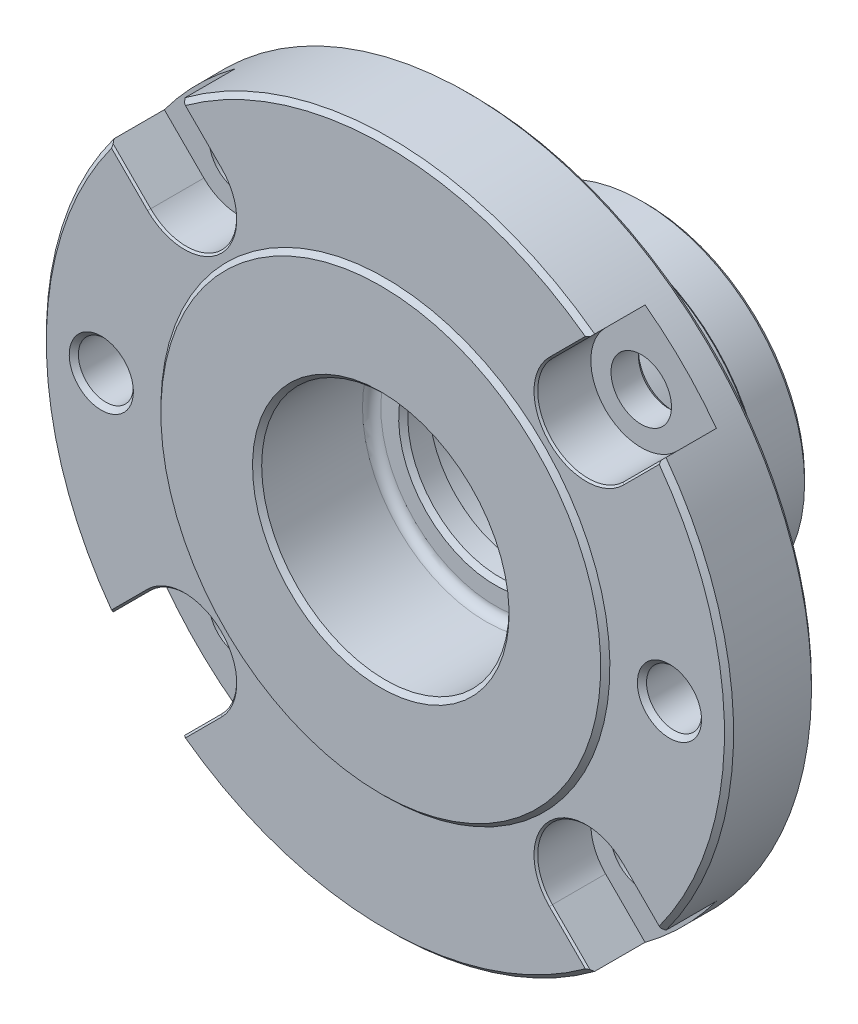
ISO-10303-21;
HEADER;
FILE_DESCRIPTION(('STEP AP214'),'2;1');
FILE_NAME('part.step','',(''),(''),'','','');
FILE_SCHEMA(('AUTOMOTIVE_DESIGN { 1 0 10303 214 1 1 1 1 }'));
ENDSEC;
DATA;
#1=APPLICATION_CONTEXT('core data for automotive mechanical design processes');
#2=APPLICATION_PROTOCOL_DEFINITION('international standard','automotive_design',2000,#1);
#3=PRODUCT_CONTEXT('',#1,'mechanical');
#4=PRODUCT('Part','Part','',(#3));
#5=PRODUCT_RELATED_PRODUCT_CATEGORY('part','',(#4));
#6=PRODUCT_DEFINITION_FORMATION('','',#4);
#7=PRODUCT_DEFINITION_CONTEXT('part definition',#1,'design');
#8=PRODUCT_DEFINITION('design','',#6,#7);
#9=PRODUCT_DEFINITION_SHAPE('','',#8);
#10=(LENGTH_UNIT() NAMED_UNIT(*) SI_UNIT(.MILLI.,.METRE.));
#11=(NAMED_UNIT(*) PLANE_ANGLE_UNIT() SI_UNIT($,.RADIAN.));
#12=(NAMED_UNIT(*) SI_UNIT($,.STERADIAN.) SOLID_ANGLE_UNIT());
#13=UNCERTAINTY_MEASURE_WITH_UNIT(LENGTH_MEASURE(1.E-05),#10,'distance_accuracy_value','');
#14=(GEOMETRIC_REPRESENTATION_CONTEXT(3) GLOBAL_UNCERTAINTY_ASSIGNED_CONTEXT((#13)) GLOBAL_UNIT_ASSIGNED_CONTEXT((#10,
#11,#12)) REPRESENTATION_CONTEXT('',''));
#15=CARTESIAN_POINT('',(0.,0.,0.));
#16=DIRECTION('',(0.,0.,1.));
#17=DIRECTION('',(1.,0.,0.));
#18=AXIS2_PLACEMENT_3D('',#15,#16,#17);
#19=CARTESIAN_POINT('',(-13.5,0.,10.));
#20=DIRECTION('',(0.,0.,1.));
#21=DIRECTION('',(0.,1.,0.));
#22=AXIS2_PLACEMENT_3D('',#19,#20,#21);
#23=PLANE('',#22);
#24=CARTESIAN_POINT('',(0.,0.,10.));
#25=DIRECTION('',(0.,0.,1.));
#26=DIRECTION('',(0.,1.,0.));
#27=AXIS2_PLACEMENT_3D('',#24,#25,#26);
#28=CIRCLE('',#27,14.);
#29=CARTESIAN_POINT('',(0.,14.,10.));
#30=VERTEX_POINT('',#29);
#31=EDGE_CURVE('E9',#30,#30,#28,.F.);
#32=ORIENTED_EDGE('',*,*,#31,.T.);
#33=EDGE_LOOP('',(#32));
#34=FACE_BOUND('',#33,.T.);
#35=CARTESIAN_POINT('',(0.,0.,10.));
#36=DIRECTION('',(0.,0.,-1.));
#37=DIRECTION('',(0.,-1.,0.));
#38=AXIS2_PLACEMENT_3D('',#35,#36,#37);
#39=CIRCLE('',#38,24.);
#40=CARTESIAN_POINT('',(0.,-24.,10.));
#41=VERTEX_POINT('',#40);
#42=EDGE_CURVE('E530',#41,#41,#39,.T.);
#43=ORIENTED_EDGE('',*,*,#42,.F.);
#44=EDGE_LOOP('',(#43));
#45=FACE_BOUND('',#44,.T.);
#46=ADVANCED_FACE('F14',(#34,#45),#23,.T.);
#47=CARTESIAN_POINT('',(0.,0.,10.));
#48=DIRECTION('',(0.,0.,1.));
#49=DIRECTION('',(0.,1.,0.));
#50=AXIS2_PLACEMENT_3D('',#47,#48,#49);
#51=CYLINDRICAL_SURFACE('',#50,37.5);
#52=CARTESIAN_POINT('',(0.,0.,0.5));
#53=DIRECTION('',(0.,0.,-1.));
#54=DIRECTION('',(0.,-1.,0.));
#55=AXIS2_PLACEMENT_3D('',#52,#53,#54);
#56=CIRCLE('',#55,37.5);
#57=CARTESIAN_POINT('',(0.,-37.5,0.5));
#58=VERTEX_POINT('',#57);
#59=EDGE_CURVE('E325',#58,#58,#56,.F.);
#60=ORIENTED_EDGE('',*,*,#59,.T.);
#61=EDGE_LOOP('',(#60));
#62=FACE_BOUND('',#61,.T.);
#63=DIRECTION('',(0.,0.,1.));
#64=VECTOR('',#63,1.);
#65=CARTESIAN_POINT('',(22.3406668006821,-30.1188413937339,10.));
#66=LINE('',#65,#64);
#67=CARTESIAN_POINT('',(22.3406668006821,-30.1188413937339,9.));
#68=VERTEX_POINT('',#67);
#69=CARTESIAN_POINT('',(22.3406668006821,-30.1188413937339,3.5));
#70=VERTEX_POINT('',#69);
#71=EDGE_CURVE('E226',#68,#70,#66,.F.);
#72=ORIENTED_EDGE('',*,*,#71,.F.);
#73=CARTESIAN_POINT('',(0.,0.,9.));
#74=DIRECTION('',(0.,0.,1.));
#75=DIRECTION('',(0.,1.,0.));
#76=AXIS2_PLACEMENT_3D('',#73,#74,#75);
#77=CIRCLE('',#76,37.5);
#78=CARTESIAN_POINT('',(-22.340666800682,-30.118841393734,9.));
#79=VERTEX_POINT('',#78);
#80=EDGE_CURVE('E358',#68,#79,#77,.F.);
#81=ORIENTED_EDGE('',*,*,#80,.T.);
#82=DIRECTION('',(0.,0.,1.));
#83=VECTOR('',#82,1.);
#84=CARTESIAN_POINT('',(-22.340666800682,-30.118841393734,10.));
#85=LINE('',#84,#83);
#86=CARTESIAN_POINT('',(-22.340666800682,-30.118841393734,3.5));
#87=VERTEX_POINT('',#86);
#88=EDGE_CURVE('E270',#87,#79,#85,.T.);
#89=ORIENTED_EDGE('',*,*,#88,.F.);
#90=CARTESIAN_POINT('',(0.,0.,3.5));
#91=DIRECTION('',(0.,0.,-1.));
#92=DIRECTION('',(0.,-1.,0.));
#93=AXIS2_PLACEMENT_3D('',#90,#91,#92);
#94=CIRCLE('',#93,37.5);
#95=CARTESIAN_POINT('',(-30.118841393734,-22.3406668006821,3.5));
#96=VERTEX_POINT('',#95);
#97=EDGE_CURVE('E275',#96,#87,#94,.F.);
#98=ORIENTED_EDGE('',*,*,#97,.F.);
#99=DIRECTION('',(0.,0.,1.));
#100=VECTOR('',#99,1.);
#101=CARTESIAN_POINT('',(-30.118841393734,-22.3406668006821,10.));
#102=LINE('',#101,#100);
#103=CARTESIAN_POINT('',(-30.118841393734,-22.3406668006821,9.));
#104=VERTEX_POINT('',#103);
#105=EDGE_CURVE('E273',#104,#96,#102,.F.);
#106=ORIENTED_EDGE('',*,*,#105,.F.);
#107=CARTESIAN_POINT('',(0.,0.,9.));
#108=DIRECTION('',(0.,0.,1.));
#109=DIRECTION('',(0.,1.,0.));
#110=AXIS2_PLACEMENT_3D('',#107,#108,#109);
#111=CIRCLE('',#110,37.5);
#112=CARTESIAN_POINT('',(-30.1188413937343,22.3406668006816,9.));
#113=VERTEX_POINT('',#112);
#114=EDGE_CURVE('E355',#104,#113,#111,.F.);
#115=ORIENTED_EDGE('',*,*,#114,.T.);
#116=DIRECTION('',(0.,0.,1.));
#117=VECTOR('',#116,1.);
#118=CARTESIAN_POINT('',(-30.1188413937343,22.3406668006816,10.));
#119=LINE('',#118,#117);
#120=CARTESIAN_POINT('',(-30.1188413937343,22.3406668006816,3.5));
#121=VERTEX_POINT('',#120);
#122=EDGE_CURVE('E538',#121,#113,#119,.T.);
#123=ORIENTED_EDGE('',*,*,#122,.F.);
#124=CARTESIAN_POINT('',(0.,0.,3.5));
#125=DIRECTION('',(0.,0.,-1.));
#126=DIRECTION('',(0.,-1.,0.));
#127=AXIS2_PLACEMENT_3D('',#124,#125,#126);
#128=CIRCLE('',#127,37.5);
#129=CARTESIAN_POINT('',(-22.3406668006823,30.1188413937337,3.5));
#130=VERTEX_POINT('',#129);
#131=EDGE_CURVE('E210',#130,#121,#128,.F.);
#132=ORIENTED_EDGE('',*,*,#131,.F.);
#133=DIRECTION('',(0.,0.,1.));
#134=VECTOR('',#133,1.);
#135=CARTESIAN_POINT('',(-22.3406668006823,30.1188413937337,10.));
#136=LINE('',#135,#134);
#137=CARTESIAN_POINT('',(-22.3406668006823,30.1188413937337,9.));
#138=VERTEX_POINT('',#137);
#139=EDGE_CURVE('E540',#138,#130,#136,.F.);
#140=ORIENTED_EDGE('',*,*,#139,.F.);
#141=CARTESIAN_POINT('',(0.,0.,9.));
#142=DIRECTION('',(0.,0.,1.));
#143=DIRECTION('',(0.,1.,0.));
#144=AXIS2_PLACEMENT_3D('',#141,#142,#143);
#145=CIRCLE('',#144,37.5);
#146=CARTESIAN_POINT('',(22.3406668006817,30.1188413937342,9.));
#147=VERTEX_POINT('',#146);
#148=EDGE_CURVE('E352',#138,#147,#145,.F.);
#149=ORIENTED_EDGE('',*,*,#148,.T.);
#150=DIRECTION('',(0.,0.,1.));
#151=VECTOR('',#150,1.);
#152=CARTESIAN_POINT('',(22.3406668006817,30.1188413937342,10.));
#153=LINE('',#152,#151);
#154=CARTESIAN_POINT('',(22.3406668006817,30.1188413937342,3.5));
#155=VERTEX_POINT('',#154);
#156=EDGE_CURVE('E554',#155,#147,#153,.T.);
#157=ORIENTED_EDGE('',*,*,#156,.F.);
#158=CARTESIAN_POINT('',(0.,0.,3.5));
#159=DIRECTION('',(0.,0.,-1.));
#160=DIRECTION('',(0.,-1.,0.));
#161=AXIS2_PLACEMENT_3D('',#158,#159,#160);
#162=CIRCLE('',#161,37.5);
#163=CARTESIAN_POINT('',(30.1188413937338,22.3406668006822,3.5));
#164=VERTEX_POINT('',#163);
#165=EDGE_CURVE('E559',#164,#155,#162,.F.);
#166=ORIENTED_EDGE('',*,*,#165,.F.);
#167=DIRECTION('',(0.,0.,1.));
#168=VECTOR('',#167,1.);
#169=CARTESIAN_POINT('',(30.1188413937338,22.3406668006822,10.));
#170=LINE('',#169,#168);
#171=CARTESIAN_POINT('',(30.1188413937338,22.3406668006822,9.));
#172=VERTEX_POINT('',#171);
#173=EDGE_CURVE('E557',#172,#164,#170,.F.);
#174=ORIENTED_EDGE('',*,*,#173,.F.);
#175=CARTESIAN_POINT('',(0.,0.,9.));
#176=DIRECTION('',(0.,0.,1.));
#177=DIRECTION('',(0.,1.,0.));
#178=AXIS2_PLACEMENT_3D('',#175,#176,#177);
#179=CIRCLE('',#178,37.5);
#180=CARTESIAN_POINT('',(30.1188413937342,-22.3406668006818,9.));
#181=VERTEX_POINT('',#180);
#182=EDGE_CURVE('E349',#172,#181,#179,.F.);
#183=ORIENTED_EDGE('',*,*,#182,.T.);
#184=DIRECTION('',(0.,0.,1.));
#185=VECTOR('',#184,1.);
#186=CARTESIAN_POINT('',(30.1188413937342,-22.3406668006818,10.));
#187=LINE('',#186,#185);
#188=CARTESIAN_POINT('',(30.1188413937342,-22.3406668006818,3.5));
#189=VERTEX_POINT('',#188);
#190=EDGE_CURVE('E572',#189,#181,#187,.T.);
#191=ORIENTED_EDGE('',*,*,#190,.F.);
#192=CARTESIAN_POINT('',(0.,0.,3.5));
#193=DIRECTION('',(0.,0.,-1.));
#194=DIRECTION('',(0.,-1.,0.));
#195=AXIS2_PLACEMENT_3D('',#192,#193,#194);
#196=CIRCLE('',#195,37.5);
#197=EDGE_CURVE('E221',#70,#189,#196,.F.);
#198=ORIENTED_EDGE('',*,*,#197,.F.);
#199=EDGE_LOOP('',(#72,#81,#89,#98,#106,#115,#123,#132,#140,#149,#157,#166,#174,#183,#191,#198));
#200=FACE_BOUND('',#199,.T.);
#201=ADVANCED_FACE('F588',(#62,#200),#51,.T.);
#202=CARTESIAN_POINT('',(-21.920310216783,-21.920310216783,10.));
#203=DIRECTION('',(0.,0.,1.));
#204=DIRECTION('',(0.,1.,0.));
#205=AXIS2_PLACEMENT_3D('',#202,#203,#204);
#206=CYLINDRICAL_SURFACE('',#205,5.5);
#207=DIRECTION('',(0.,0.,1.));
#208=VECTOR('',#207,1.);
#209=CARTESIAN_POINT('',(-18.0312229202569,-25.809397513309,-16.300793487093));
#210=LINE('',#209,#208);
#211=CARTESIAN_POINT('',(-18.0312229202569,-25.809397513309,3.5));
#212=VERTEX_POINT('',#211);
#213=CARTESIAN_POINT('',(-18.0312229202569,-25.809397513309,9.3));
#214=VERTEX_POINT('',#213);
#215=EDGE_CURVE('E264',#212,#214,#210,.T.);
#216=ORIENTED_EDGE('',*,*,#215,.T.);
#217=CARTESIAN_POINT('',(-21.920310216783,-21.920310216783,9.3));
#218=DIRECTION('',(0.,0.,1.));
#219=DIRECTION('',(0.,1.,0.));
#220=AXIS2_PLACEMENT_3D('',#217,#218,#219);
#221=CIRCLE('',#220,5.5);
#222=CARTESIAN_POINT('',(-25.809397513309,-18.031222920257,9.3));
#223=VERTEX_POINT('',#222);
#224=EDGE_CURVE('E646',#214,#223,#221,.T.);
#225=ORIENTED_EDGE('',*,*,#224,.T.);
#226=DIRECTION('',(0.,0.,1.));
#227=VECTOR('',#226,1.);
#228=CARTESIAN_POINT('',(-25.809397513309,-18.031222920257,-16.300793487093));
#229=LINE('',#228,#227);
#230=CARTESIAN_POINT('',(-25.809397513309,-18.031222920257,3.5));
#231=VERTEX_POINT('',#230);
#232=EDGE_CURVE('E267',#231,#223,#229,.T.);
#233=ORIENTED_EDGE('',*,*,#232,.F.);
#234=CARTESIAN_POINT('',(-21.920310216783,-21.920310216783,3.5));
#235=DIRECTION('',(0.,0.,1.));
#236=DIRECTION('',(0.,1.,0.));
#237=AXIS2_PLACEMENT_3D('',#234,#235,#236);
#238=CIRCLE('',#237,5.5);
#239=EDGE_CURVE('E277',#212,#231,#238,.T.);
#240=ORIENTED_EDGE('',*,*,#239,.F.);
#241=EDGE_LOOP('',(#216,#225,#233,#240));
#242=FACE_BOUND('',#241,.T.);
#243=ADVANCED_FACE('F389',(#242),#206,.F.);
#244=CARTESIAN_POINT('',(-25.809397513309,-18.031222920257,-16.300793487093));
#245=DIRECTION('',(-0.707106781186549,0.707106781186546,0.));
#246=DIRECTION('',(0.707106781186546,0.707106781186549,0.));
#247=AXIS2_PLACEMENT_3D('',#244,#245,#246);
#248=PLANE('',#247);
#249=ORIENTED_EDGE('',*,*,#232,.T.);
#250=DIRECTION('',(-0.707106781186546,-0.707106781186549,0.));
#251=VECTOR('',#250,1.);
#252=CARTESIAN_POINT('',(-29.7613697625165,-21.9831951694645,9.3));
#253=LINE('',#252,#251);
#254=CARTESIAN_POINT('',(-29.9043712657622,-22.1261966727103,9.3));
#255=VERTEX_POINT('',#254);
#256=EDGE_CURVE('E435',#223,#255,#253,.T.);
#257=ORIENTED_EDGE('',*,*,#256,.T.);
#258=CARTESIAN_POINT('',(-29.7613697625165,-21.9831951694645,9.5));
#259=CARTESIAN_POINT('',(-29.820952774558,-22.0427781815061,9.41667296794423));
#260=CARTESIAN_POINT('',(-29.8805335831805,-22.1023589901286,9.33334278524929));
#261=CARTESIAN_POINT('',(-29.9996907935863,-22.2215162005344,9.16667611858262));
#262=CARTESIAN_POINT('',(-30.0592671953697,-22.2810926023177,9.0833396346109));
#263=CARTESIAN_POINT('',(-30.118841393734,-22.3406668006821,9.));
#264=B_SPLINE_CURVE_WITH_KNOTS('',3,(#258,#259,#260,#261,#262,#263),.UNSPECIFIED.,.F.,.F.,(4,2,
4),(0.,0.355517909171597,0.711035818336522),.UNSPECIFIED.);
#265=EDGE_CURVE('E393',#255,#104,#264,.T.);
#266=ORIENTED_EDGE('',*,*,#265,.T.);
#267=ORIENTED_EDGE('',*,*,#105,.T.);
#268=DIRECTION('',(-0.707106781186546,-0.707106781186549,0.));
#269=VECTOR('',#268,1.);
#270=CARTESIAN_POINT('',(-25.809397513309,-18.031222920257,3.5));
#271=LINE('',#270,#269);
#272=EDGE_CURVE('E259',#231,#96,#271,.T.);
#273=ORIENTED_EDGE('',*,*,#272,.F.);
#274=EDGE_LOOP('',(#249,#257,#266,#267,#273));
#275=FACE_BOUND('',#274,.T.);
#276=ADVANCED_FACE('F382',(#275),#248,.F.);
#277=CARTESIAN_POINT('',(-18.0312229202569,-25.809397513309,-16.300793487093));
#278=DIRECTION('',(0.707106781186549,-0.707106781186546,0.));
#279=DIRECTION('',(-0.707106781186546,-0.707106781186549,0.));
#280=AXIS2_PLACEMENT_3D('',#277,#278,#279);
#281=PLANE('',#280);
#282=CARTESIAN_POINT('',(-22.340666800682,-30.118841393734,9.));
#283=CARTESIAN_POINT('',(-22.2810926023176,-30.0592671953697,9.0833396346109));
#284=CARTESIAN_POINT('',(-22.2215162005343,-29.9996907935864,9.16667611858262));
#285=CARTESIAN_POINT('',(-22.1023589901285,-29.8805335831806,9.33334278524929));
#286=CARTESIAN_POINT('',(-22.042778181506,-29.8209527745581,9.41667296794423));
#287=CARTESIAN_POINT('',(-21.9831951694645,-29.7613697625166,9.5));
#288=B_SPLINE_CURVE_WITH_KNOTS('',3,(#282,#283,#284,#285,#286,#287),.UNSPECIFIED.,.F.,.F.,(4,2,
4),(0.,0.355517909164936,0.711035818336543),.UNSPECIFIED.);
#289=CARTESIAN_POINT('',(-22.1261966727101,-29.9043712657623,9.3));
#290=VERTEX_POINT('',#289);
#291=EDGE_CURVE('E361',#79,#290,#288,.T.);
#292=ORIENTED_EDGE('',*,*,#291,.T.);
#293=DIRECTION('',(0.707106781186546,0.707106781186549,0.));
#294=VECTOR('',#293,1.);
#295=CARTESIAN_POINT('',(-18.0312229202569,-25.809397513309,9.3));
#296=LINE('',#295,#294);
#297=EDGE_CURVE('E611',#290,#214,#296,.T.);
#298=ORIENTED_EDGE('',*,*,#297,.T.);
#299=ORIENTED_EDGE('',*,*,#215,.F.);
#300=DIRECTION('',(0.707106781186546,0.707106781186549,0.));
#301=VECTOR('',#300,1.);
#302=CARTESIAN_POINT('',(-18.0312229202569,-25.809397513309,3.5));
#303=LINE('',#302,#301);
#304=EDGE_CURVE('E262',#87,#212,#303,.T.);
#305=ORIENTED_EDGE('',*,*,#304,.F.);
#306=ORIENTED_EDGE('',*,*,#88,.T.);
#307=EDGE_LOOP('',(#292,#298,#299,#305,#306));
#308=FACE_BOUND('',#307,.T.);
#309=ADVANCED_FACE('F376',(#308),#281,.F.);
#310=CARTESIAN_POINT('',(21.9203102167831,-21.9203102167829,10.));
#311=DIRECTION('',(0.,0.,1.));
#312=DIRECTION('',(0.,1.,0.));
#313=AXIS2_PLACEMENT_3D('',#310,#311,#312);
#314=CYLINDRICAL_SURFACE('',#313,5.5);
#315=DIRECTION('',(0.,0.,1.));
#316=VECTOR('',#315,1.);
#317=CARTESIAN_POINT('',(25.8093975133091,-18.0312229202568,-16.300793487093));
#318=LINE('',#317,#316);
#319=CARTESIAN_POINT('',(25.8093975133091,-18.0312229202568,3.5));
#320=VERTEX_POINT('',#319);
#321=CARTESIAN_POINT('',(25.8093975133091,-18.0312229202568,9.3));
#322=VERTEX_POINT('',#321);
#323=EDGE_CURVE('E566',#320,#322,#318,.T.);
#324=ORIENTED_EDGE('',*,*,#323,.T.);
#325=CARTESIAN_POINT('',(21.9203102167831,-21.9203102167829,9.3));
#326=DIRECTION('',(0.,0.,1.));
#327=DIRECTION('',(0.,1.,0.));
#328=AXIS2_PLACEMENT_3D('',#325,#326,#327);
#329=CIRCLE('',#328,5.5);
#330=CARTESIAN_POINT('',(18.0312229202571,-25.8093975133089,9.3));
#331=VERTEX_POINT('',#330);
#332=EDGE_CURVE('E601',#322,#331,#329,.T.);
#333=ORIENTED_EDGE('',*,*,#332,.T.);
#334=DIRECTION('',(0.,0.,1.));
#335=VECTOR('',#334,1.);
#336=CARTESIAN_POINT('',(18.0312229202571,-25.8093975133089,-16.300793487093));
#337=LINE('',#336,#335);
#338=CARTESIAN_POINT('',(18.0312229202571,-25.8093975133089,3.5));
#339=VERTEX_POINT('',#338);
#340=EDGE_CURVE('E569',#339,#331,#337,.T.);
#341=ORIENTED_EDGE('',*,*,#340,.F.);
#342=CARTESIAN_POINT('',(21.9203102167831,-21.9203102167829,3.5));
#343=DIRECTION('',(0.,0.,1.));
#344=DIRECTION('',(0.,1.,0.));
#345=AXIS2_PLACEMENT_3D('',#342,#343,#344);
#346=CIRCLE('',#345,5.5);
#347=EDGE_CURVE('E247',#320,#339,#346,.T.);
#348=ORIENTED_EDGE('',*,*,#347,.F.);
#349=EDGE_LOOP('',(#324,#333,#341,#348));
#350=FACE_BOUND('',#349,.T.);
#351=ADVANCED_FACE('F381',(#350),#314,.F.);
#352=CARTESIAN_POINT('',(21.9203102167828,21.9203102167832,10.));
#353=DIRECTION('',(0.,0.,1.));
#354=DIRECTION('',(0.,1.,0.));
#355=AXIS2_PLACEMENT_3D('',#352,#353,#354);
#356=CYLINDRICAL_SURFACE('',#355,5.5);
#357=DIRECTION('',(0.,0.,1.));
#358=VECTOR('',#357,1.);
#359=CARTESIAN_POINT('',(18.0312229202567,25.8093975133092,-16.300793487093));
#360=LINE('',#359,#358);
#361=CARTESIAN_POINT('',(18.0312229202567,25.8093975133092,3.5));
#362=VERTEX_POINT('',#361);
#363=CARTESIAN_POINT('',(18.0312229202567,25.8093975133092,9.3));
#364=VERTEX_POINT('',#363);
#365=EDGE_CURVE('E548',#362,#364,#360,.T.);
#366=ORIENTED_EDGE('',*,*,#365,.T.);
#367=CARTESIAN_POINT('',(21.9203102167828,21.9203102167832,9.3));
#368=DIRECTION('',(0.,0.,1.));
#369=DIRECTION('',(0.,1.,0.));
#370=AXIS2_PLACEMENT_3D('',#367,#368,#369);
#371=CIRCLE('',#370,5.5);
#372=CARTESIAN_POINT('',(25.8093975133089,18.0312229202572,9.3));
#373=VERTEX_POINT('',#372);
#374=EDGE_CURVE('E469',#364,#373,#371,.T.);
#375=ORIENTED_EDGE('',*,*,#374,.T.);
#376=DIRECTION('',(0.,0.,1.));
#377=VECTOR('',#376,1.);
#378=CARTESIAN_POINT('',(25.8093975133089,18.0312229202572,-16.300793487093));
#379=LINE('',#378,#377);
#380=CARTESIAN_POINT('',(25.8093975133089,18.0312229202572,3.5));
#381=VERTEX_POINT('',#380);
#382=EDGE_CURVE('E551',#381,#373,#379,.T.);
#383=ORIENTED_EDGE('',*,*,#382,.F.);
#384=CARTESIAN_POINT('',(21.9203102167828,21.9203102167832,3.5));
#385=DIRECTION('',(0.,0.,1.));
#386=DIRECTION('',(0.,1.,0.));
#387=AXIS2_PLACEMENT_3D('',#384,#385,#386);
#388=CIRCLE('',#387,5.5);
#389=EDGE_CURVE('E235',#362,#381,#388,.T.);
#390=ORIENTED_EDGE('',*,*,#389,.F.);
#391=EDGE_LOOP('',(#366,#375,#383,#390));
#392=FACE_BOUND('',#391,.T.);
#393=ADVANCED_FACE('F798',(#392),#356,.F.);
#394=CARTESIAN_POINT('',(-21.9203102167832,21.9203102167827,10.));
#395=DIRECTION('',(0.,0.,1.));
#396=DIRECTION('',(0.,1.,0.));
#397=AXIS2_PLACEMENT_3D('',#394,#395,#396);
#398=CYLINDRICAL_SURFACE('',#397,5.5);
#399=DIRECTION('',(0.,0.,1.));
#400=VECTOR('',#399,1.);
#401=CARTESIAN_POINT('',(-25.8093975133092,18.0312229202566,-16.300793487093));
#402=LINE('',#401,#400);
#403=CARTESIAN_POINT('',(-25.8093975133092,18.0312229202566,3.5));
#404=VERTEX_POINT('',#403);
#405=CARTESIAN_POINT('',(-25.8093975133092,18.0312229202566,9.3));
#406=VERTEX_POINT('',#405);
#407=EDGE_CURVE('E213',#404,#406,#402,.T.);
#408=ORIENTED_EDGE('',*,*,#407,.T.);
#409=CARTESIAN_POINT('',(-21.9203102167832,21.9203102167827,9.3));
#410=DIRECTION('',(0.,0.,1.));
#411=DIRECTION('',(0.,1.,0.));
#412=AXIS2_PLACEMENT_3D('',#409,#410,#411);
#413=CIRCLE('',#412,5.5);
#414=CARTESIAN_POINT('',(-18.0312229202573,25.8093975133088,9.3));
#415=VERTEX_POINT('',#414);
#416=EDGE_CURVE('E31',#406,#415,#413,.T.);
#417=ORIENTED_EDGE('',*,*,#416,.T.);
#418=DIRECTION('',(0.,0.,1.));
#419=VECTOR('',#418,1.);
#420=CARTESIAN_POINT('',(-18.0312229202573,25.8093975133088,-16.300793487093));
#421=LINE('',#420,#419);
#422=CARTESIAN_POINT('',(-18.0312229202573,25.8093975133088,3.5));
#423=VERTEX_POINT('',#422);
#424=EDGE_CURVE('E217',#423,#415,#421,.T.);
#425=ORIENTED_EDGE('',*,*,#424,.F.);
#426=CARTESIAN_POINT('',(-21.9203102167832,21.9203102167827,3.5));
#427=DIRECTION('',(0.,0.,1.));
#428=DIRECTION('',(0.,1.,0.));
#429=AXIS2_PLACEMENT_3D('',#426,#427,#428);
#430=CIRCLE('',#429,5.5);
#431=EDGE_CURVE('E208',#404,#423,#430,.T.);
#432=ORIENTED_EDGE('',*,*,#431,.F.);
#433=EDGE_LOOP('',(#408,#417,#425,#432));
#434=FACE_BOUND('',#433,.T.);
#435=ADVANCED_FACE('F219',(#434),#398,.F.);
#436=CARTESIAN_POINT('',(18.0312229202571,-25.8093975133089,-16.300793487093));
#437=DIRECTION('',(-0.707106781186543,-0.707106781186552,0.));
#438=DIRECTION('',(-0.707106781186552,0.707106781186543,0.));
#439=AXIS2_PLACEMENT_3D('',#436,#437,#438);
#440=PLANE('',#439);
#441=ORIENTED_EDGE('',*,*,#340,.T.);
#442=DIRECTION('',(0.707106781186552,-0.707106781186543,0.));
#443=VECTOR('',#442,1.);
#444=CARTESIAN_POINT('',(21.9831951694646,-29.7613697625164,9.3));
#445=LINE('',#444,#443);
#446=CARTESIAN_POINT('',(22.1261966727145,-29.9043712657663,9.29999999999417));
#447=VERTEX_POINT('',#446);
#448=EDGE_CURVE('E603',#331,#447,#445,.T.);
#449=ORIENTED_EDGE('',*,*,#448,.T.);
#450=CARTESIAN_POINT('',(21.9831951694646,-29.7613697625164,9.5));
#451=CARTESIAN_POINT('',(22.0427781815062,-29.8209527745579,9.41667296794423));
#452=CARTESIAN_POINT('',(22.1023589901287,-29.8805335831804,9.33334278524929));
#453=CARTESIAN_POINT('',(22.2215162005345,-29.9996907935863,9.16667611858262));
#454=CARTESIAN_POINT('',(22.2810926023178,-30.0592671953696,9.0833396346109));
#455=CARTESIAN_POINT('',(22.3406668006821,-30.1188413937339,9.));
#456=B_SPLINE_CURVE_WITH_KNOTS('',3,(#450,#451,#452,#453,#454,#455),.UNSPECIFIED.,.F.,.F.,(4,2,
4),(0.,0.35551790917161,0.711035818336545),.UNSPECIFIED.);
#457=EDGE_CURVE('E579',#447,#68,#456,.T.);
#458=ORIENTED_EDGE('',*,*,#457,.T.);
#459=ORIENTED_EDGE('',*,*,#71,.T.);
#460=DIRECTION('',(0.707106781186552,-0.707106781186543,0.));
#461=VECTOR('',#460,1.);
#462=CARTESIAN_POINT('',(18.0312229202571,-25.8093975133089,3.5));
#463=LINE('',#462,#461);
#464=EDGE_CURVE('E561',#339,#70,#463,.T.);
#465=ORIENTED_EDGE('',*,*,#464,.F.);
#466=EDGE_LOOP('',(#441,#449,#458,#459,#465));
#467=FACE_BOUND('',#466,.T.);
#468=ADVANCED_FACE('F576',(#467),#440,.F.);
#469=CARTESIAN_POINT('',(25.8093975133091,-18.0312229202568,-16.300793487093));
#470=DIRECTION('',(0.707106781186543,0.707106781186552,0.));
#471=DIRECTION('',(0.707106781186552,-0.707106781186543,0.));
#472=AXIS2_PLACEMENT_3D('',#469,#470,#471);
#473=PLANE('',#472);
#474=CARTESIAN_POINT('',(30.1188413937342,-22.3406668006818,9.));
#475=CARTESIAN_POINT('',(30.0592671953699,-22.2810926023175,9.08333963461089));
#476=CARTESIAN_POINT('',(29.9996907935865,-22.2215162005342,9.16667611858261));
#477=CARTESIAN_POINT('',(29.8805335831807,-22.1023589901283,9.33334278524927));
#478=CARTESIAN_POINT('',(29.8209527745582,-22.0427781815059,9.41667296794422));
#479=CARTESIAN_POINT('',(29.7613697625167,-21.9831951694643,9.5));
#480=B_SPLINE_CURVE_WITH_KNOTS('',3,(#474,#475,#476,#477,#478,#479),.UNSPECIFIED.,.F.,.F.,(4,2,
4),(0.,0.355517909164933,0.711035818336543),.UNSPECIFIED.);
#481=CARTESIAN_POINT('',(29.9043712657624,-22.12619667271,9.3));
#482=VERTEX_POINT('',#481);
#483=EDGE_CURVE('E594',#181,#482,#480,.T.);
#484=ORIENTED_EDGE('',*,*,#483,.T.);
#485=DIRECTION('',(-0.707106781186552,0.707106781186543,0.));
#486=VECTOR('',#485,1.);
#487=CARTESIAN_POINT('',(25.8093975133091,-18.0312229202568,9.3));
#488=LINE('',#487,#486);
#489=EDGE_CURVE('E597',#482,#322,#488,.T.);
#490=ORIENTED_EDGE('',*,*,#489,.T.);
#491=ORIENTED_EDGE('',*,*,#323,.F.);
#492=DIRECTION('',(-0.707106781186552,0.707106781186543,0.));
#493=VECTOR('',#492,1.);
#494=CARTESIAN_POINT('',(25.8093975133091,-18.0312229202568,3.5));
#495=LINE('',#494,#493);
#496=EDGE_CURVE('E564',#189,#320,#495,.T.);
#497=ORIENTED_EDGE('',*,*,#496,.F.);
#498=ORIENTED_EDGE('',*,*,#190,.T.);
#499=EDGE_LOOP('',(#484,#490,#491,#497,#498));
#500=FACE_BOUND('',#499,.T.);
#501=ADVANCED_FACE('F593',(#500),#473,.F.);
#502=CARTESIAN_POINT('',(25.8093975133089,18.0312229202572,-16.300793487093));
#503=DIRECTION('',(0.707106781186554,-0.707106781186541,0.));
#504=DIRECTION('',(-0.707106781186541,-0.707106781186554,0.));
#505=AXIS2_PLACEMENT_3D('',#502,#503,#504);
#506=PLANE('',#505);
#507=ORIENTED_EDGE('',*,*,#382,.T.);
#508=DIRECTION('',(0.707106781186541,0.707106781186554,0.));
#509=VECTOR('',#508,1.);
#510=CARTESIAN_POINT('',(29.7613697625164,21.9831951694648,9.3));
#511=LINE('',#510,#509);
#512=CARTESIAN_POINT('',(29.9043712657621,22.1261966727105,9.3));
#513=VERTEX_POINT('',#512);
#514=EDGE_CURVE('E784',#373,#513,#511,.T.);
#515=ORIENTED_EDGE('',*,*,#514,.T.);
#516=CARTESIAN_POINT('',(29.7613697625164,21.9831951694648,9.5));
#517=CARTESIAN_POINT('',(29.8209527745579,22.0427781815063,9.41667296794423));
#518=CARTESIAN_POINT('',(29.8805335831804,22.1023589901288,9.33334278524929));
#519=CARTESIAN_POINT('',(29.9996907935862,22.2215162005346,9.16667611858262));
#520=CARTESIAN_POINT('',(30.0592671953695,22.2810926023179,9.0833396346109));
#521=CARTESIAN_POINT('',(30.1188413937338,22.3406668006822,9.));
#522=B_SPLINE_CURVE_WITH_KNOTS('',3,(#516,#517,#518,#519,#520,#521),.UNSPECIFIED.,.F.,.F.,(4,2,
4),(0.,0.355517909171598,0.711035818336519),.UNSPECIFIED.);
#523=EDGE_CURVE('E706',#513,#172,#522,.T.);
#524=ORIENTED_EDGE('',*,*,#523,.T.);
#525=ORIENTED_EDGE('',*,*,#173,.T.);
#526=DIRECTION('',(0.707106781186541,0.707106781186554,0.));
#527=VECTOR('',#526,1.);
#528=CARTESIAN_POINT('',(25.8093975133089,18.0312229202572,3.5));
#529=LINE('',#528,#527);
#530=EDGE_CURVE('E543',#381,#164,#529,.T.);
#531=ORIENTED_EDGE('',*,*,#530,.F.);
#532=EDGE_LOOP('',(#507,#515,#524,#525,#531));
#533=FACE_BOUND('',#532,.T.);
#534=ADVANCED_FACE('F715',(#533),#506,.F.);
#535=CARTESIAN_POINT('',(18.0312229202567,25.8093975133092,-16.300793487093));
#536=DIRECTION('',(-0.707106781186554,0.707106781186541,0.));
#537=DIRECTION('',(0.707106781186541,0.707106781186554,0.));
#538=AXIS2_PLACEMENT_3D('',#535,#536,#537);
#539=PLANE('',#538);
#540=CARTESIAN_POINT('',(22.3406668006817,30.1188413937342,9.));
#541=CARTESIAN_POINT('',(22.2810926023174,30.0592671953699,9.0833396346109));
#542=CARTESIAN_POINT('',(22.2215162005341,29.9996907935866,9.16667611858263));
#543=CARTESIAN_POINT('',(22.1023589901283,29.8805335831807,9.33334278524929));
#544=CARTESIAN_POINT('',(22.0427781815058,29.8209527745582,9.41667296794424));
#545=CARTESIAN_POINT('',(21.9831951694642,29.7613697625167,9.5));
#546=B_SPLINE_CURVE_WITH_KNOTS('',3,(#540,#541,#542,#543,#544,#545),.UNSPECIFIED.,.F.,.F.,(4,2,
4),(0.,0.355517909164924,0.71103581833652),.UNSPECIFIED.);
#547=CARTESIAN_POINT('',(22.1261966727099,29.9043712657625,9.3));
#548=VERTEX_POINT('',#547);
#549=EDGE_CURVE('E400',#147,#548,#546,.T.);
#550=ORIENTED_EDGE('',*,*,#549,.T.);
#551=DIRECTION('',(-0.707106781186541,-0.707106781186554,0.));
#552=VECTOR('',#551,1.);
#553=CARTESIAN_POINT('',(18.0312229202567,25.8093975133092,9.3));
#554=LINE('',#553,#552);
#555=EDGE_CURVE('E476',#548,#364,#554,.T.);
#556=ORIENTED_EDGE('',*,*,#555,.T.);
#557=ORIENTED_EDGE('',*,*,#365,.F.);
#558=DIRECTION('',(-0.707106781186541,-0.707106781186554,0.));
#559=VECTOR('',#558,1.);
#560=CARTESIAN_POINT('',(18.0312229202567,25.8093975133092,3.5));
#561=LINE('',#560,#559);
#562=EDGE_CURVE('E546',#155,#362,#561,.T.);
#563=ORIENTED_EDGE('',*,*,#562,.F.);
#564=ORIENTED_EDGE('',*,*,#156,.T.);
#565=EDGE_LOOP('',(#550,#556,#557,#563,#564));
#566=FACE_BOUND('',#565,.T.);
#567=ADVANCED_FACE('F718',(#566),#539,.F.);
#568=CARTESIAN_POINT('',(-18.0312229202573,25.8093975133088,-16.300793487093));
#569=DIRECTION('',(0.707106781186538,0.707106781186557,0.));
#570=DIRECTION('',(0.707106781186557,-0.707106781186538,0.));
#571=AXIS2_PLACEMENT_3D('',#568,#569,#570);
#572=PLANE('',#571);
#573=ORIENTED_EDGE('',*,*,#424,.T.);
#574=DIRECTION('',(-0.707106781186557,0.707106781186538,0.));
#575=VECTOR('',#574,1.);
#576=CARTESIAN_POINT('',(-21.9831951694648,29.7613697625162,9.3));
#577=LINE('',#576,#575);
#578=CARTESIAN_POINT('',(-22.1261966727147,29.9043712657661,9.29999999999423));
#579=VERTEX_POINT('',#578);
#580=EDGE_CURVE('E480',#415,#579,#577,.T.);
#581=ORIENTED_EDGE('',*,*,#580,.T.);
#582=CARTESIAN_POINT('',(-21.9831951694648,29.7613697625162,9.5));
#583=CARTESIAN_POINT('',(-22.0427781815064,29.8209527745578,9.41667296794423));
#584=CARTESIAN_POINT('',(-22.1023589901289,29.8805335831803,9.33334278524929));
#585=CARTESIAN_POINT('',(-22.2215162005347,29.9996907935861,9.16667611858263));
#586=CARTESIAN_POINT('',(-22.2810926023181,30.0592671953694,9.0833396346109));
#587=CARTESIAN_POINT('',(-22.3406668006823,30.1188413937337,9.));
#588=B_SPLINE_CURVE_WITH_KNOTS('',3,(#582,#583,#584,#585,#586,#587),.UNSPECIFIED.,.F.,.F.,(4,2,
4),(0.,0.35551790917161,0.711035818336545),.UNSPECIFIED.);
#589=EDGE_CURVE('E807',#579,#138,#588,.T.);
#590=ORIENTED_EDGE('',*,*,#589,.T.);
#591=ORIENTED_EDGE('',*,*,#139,.T.);
#592=DIRECTION('',(-0.707106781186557,0.707106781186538,0.));
#593=VECTOR('',#592,1.);
#594=CARTESIAN_POINT('',(-18.0312229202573,25.8093975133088,3.5));
#595=LINE('',#594,#593);
#596=EDGE_CURVE('E214',#423,#130,#595,.T.);
#597=ORIENTED_EDGE('',*,*,#596,.F.);
#598=EDGE_LOOP('',(#573,#581,#590,#591,#597));
#599=FACE_BOUND('',#598,.T.);
#600=ADVANCED_FACE('F814',(#599),#572,.F.);
#601=CARTESIAN_POINT('',(-25.8093975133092,18.0312229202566,-16.300793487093));
#602=DIRECTION('',(-0.707106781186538,-0.707106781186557,0.));
#603=DIRECTION('',(-0.707106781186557,0.707106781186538,0.));
#604=AXIS2_PLACEMENT_3D('',#601,#602,#603);
#605=PLANE('',#604);
#606=CARTESIAN_POINT('',(-30.1188413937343,22.3406668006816,9.));
#607=CARTESIAN_POINT('',(-30.05926719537,22.2810926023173,9.08333963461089));
#608=CARTESIAN_POINT('',(-29.9996907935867,22.221516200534,9.16667611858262));
#609=CARTESIAN_POINT('',(-29.8805335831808,22.1023589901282,9.33334278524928));
#610=CARTESIAN_POINT('',(-29.8209527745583,22.0427781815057,9.41667296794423));
#611=CARTESIAN_POINT('',(-29.7613697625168,21.9831951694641,9.5));
#612=B_SPLINE_CURVE_WITH_KNOTS('',3,(#606,#607,#608,#609,#610,#611),.UNSPECIFIED.,.F.,.F.,(4,2,
4),(0.,0.355517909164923,0.71103581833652),.UNSPECIFIED.);
#613=CARTESIAN_POINT('',(-29.9043712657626,22.1261966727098,9.3));
#614=VERTEX_POINT('',#613);
#615=EDGE_CURVE('E401',#113,#614,#612,.T.);
#616=ORIENTED_EDGE('',*,*,#615,.T.);
#617=DIRECTION('',(0.707106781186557,-0.707106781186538,0.));
#618=VECTOR('',#617,1.);
#619=CARTESIAN_POINT('',(-25.8093975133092,18.0312229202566,9.3));
#620=LINE('',#619,#618);
#621=EDGE_CURVE('E39',#614,#406,#620,.T.);
#622=ORIENTED_EDGE('',*,*,#621,.T.);
#623=ORIENTED_EDGE('',*,*,#407,.F.);
#624=DIRECTION('',(0.707106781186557,-0.707106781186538,0.));
#625=VECTOR('',#624,1.);
#626=CARTESIAN_POINT('',(-25.8093975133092,18.0312229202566,3.5));
#627=LINE('',#626,#625);
#628=EDGE_CURVE('E204',#121,#404,#627,.T.);
#629=ORIENTED_EDGE('',*,*,#628,.F.);
#630=ORIENTED_EDGE('',*,*,#122,.T.);
#631=EDGE_LOOP('',(#616,#622,#623,#629,#630));
#632=FACE_BOUND('',#631,.T.);
#633=ADVANCED_FACE('F216',(#632),#605,.F.);
#634=CARTESIAN_POINT('',(-18.,0.,0.));
#635=DIRECTION('',(0.,0.,-1.));
#636=DIRECTION('',(0.,-1.,0.));
#637=AXIS2_PLACEMENT_3D('',#634,#635,#636);
#638=PLANE('',#637);
#639=CARTESIAN_POINT('',(31.,2.13002396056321E-13,0.));
#640=DIRECTION('',(0.,0.,1.));
#641=DIRECTION('',(0.,1.,0.));
#642=AXIS2_PLACEMENT_3D('',#639,#640,#641);
#643=CIRCLE('',#642,3.5);
#644=CARTESIAN_POINT('',(31.,3.50000000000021,0.));
#645=VERTEX_POINT('',#644);
#646=EDGE_CURVE('E521',#645,#645,#643,.T.);
#647=ORIENTED_EDGE('',*,*,#646,.T.);
#648=EDGE_LOOP('',(#647));
#649=FACE_BOUND('',#648,.T.);
#650=CARTESIAN_POINT('',(-31.,0.,0.));
#651=DIRECTION('',(0.,0.,1.));
#652=DIRECTION('',(0.,1.,0.));
#653=AXIS2_PLACEMENT_3D('',#650,#651,#652);
#654=CIRCLE('',#653,3.5);
#655=CARTESIAN_POINT('',(-31.,3.5,0.));
#656=VERTEX_POINT('',#655);
#657=EDGE_CURVE('E527',#656,#656,#654,.T.);
#658=ORIENTED_EDGE('',*,*,#657,.T.);
#659=EDGE_LOOP('',(#658));
#660=FACE_BOUND('',#659,.T.);
#661=CARTESIAN_POINT('',(-21.9203102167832,21.9203102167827,0.));
#662=DIRECTION('',(0.,0.,1.));
#663=DIRECTION('',(0.,1.,0.));
#664=AXIS2_PLACEMENT_3D('',#661,#662,#663);
#665=CIRCLE('',#664,3.8);
#666=CARTESIAN_POINT('',(-21.9203102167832,25.7203102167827,0.));
#667=VERTEX_POINT('',#666);
#668=EDGE_CURVE('E232',#667,#667,#665,.T.);
#669=ORIENTED_EDGE('',*,*,#668,.T.);
#670=EDGE_LOOP('',(#669));
#671=FACE_BOUND('',#670,.T.);
#672=CARTESIAN_POINT('',(21.9203102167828,21.9203102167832,0.));
#673=DIRECTION('',(0.,0.,1.));
#674=DIRECTION('',(0.,1.,0.));
#675=AXIS2_PLACEMENT_3D('',#672,#673,#674);
#676=CIRCLE('',#675,3.8);
#677=CARTESIAN_POINT('',(21.9203102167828,25.7203102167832,0.));
#678=VERTEX_POINT('',#677);
#679=EDGE_CURVE('E244',#678,#678,#676,.T.);
#680=ORIENTED_EDGE('',*,*,#679,.T.);
#681=EDGE_LOOP('',(#680));
#682=FACE_BOUND('',#681,.T.);
#683=CARTESIAN_POINT('',(21.9203102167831,-21.9203102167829,0.));
#684=DIRECTION('',(0.,0.,1.));
#685=DIRECTION('',(0.,1.,0.));
#686=AXIS2_PLACEMENT_3D('',#683,#684,#685);
#687=CIRCLE('',#686,3.8);
#688=CARTESIAN_POINT('',(21.9203102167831,-18.1203102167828,0.));
#689=VERTEX_POINT('',#688);
#690=EDGE_CURVE('E256',#689,#689,#687,.T.);
#691=ORIENTED_EDGE('',*,*,#690,.T.);
#692=EDGE_LOOP('',(#691));
#693=FACE_BOUND('',#692,.T.);
#694=CARTESIAN_POINT('',(-21.920310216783,-21.920310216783,0.));
#695=DIRECTION('',(0.,0.,1.));
#696=DIRECTION('',(0.,1.,0.));
#697=AXIS2_PLACEMENT_3D('',#694,#695,#696);
#698=CIRCLE('',#697,3.8);
#699=CARTESIAN_POINT('',(-21.920310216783,-18.120310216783,0.));
#700=VERTEX_POINT('',#699);
#701=EDGE_CURVE('E286',#700,#700,#698,.T.);
#702=ORIENTED_EDGE('',*,*,#701,.T.);
#703=EDGE_LOOP('',(#702));
#704=FACE_BOUND('',#703,.T.);
#705=CARTESIAN_POINT('',(0.,0.,0.));
#706=DIRECTION('',(0.,0.,1.));
#707=DIRECTION('',(0.,1.,0.));
#708=AXIS2_PLACEMENT_3D('',#705,#706,#707);
#709=CIRCLE('',#708,19.);
#710=CARTESIAN_POINT('',(0.,19.,0.));
#711=VERTEX_POINT('',#710);
#712=EDGE_CURVE('E298',#711,#711,#709,.T.);
#713=ORIENTED_EDGE('',*,*,#712,.T.);
#714=EDGE_LOOP('',(#713));
#715=FACE_BOUND('',#714,.T.);
#716=CARTESIAN_POINT('',(0.,0.,0.));
#717=DIRECTION('',(0.,0.,-1.));
#718=DIRECTION('',(0.,-1.,0.));
#719=AXIS2_PLACEMENT_3D('',#716,#717,#718);
#720=CIRCLE('',#719,37.);
#721=CARTESIAN_POINT('',(0.,-37.,0.));
#722=VERTEX_POINT('',#721);
#723=EDGE_CURVE('E328',#722,#722,#720,.T.);
#724=ORIENTED_EDGE('',*,*,#723,.T.);
#725=EDGE_LOOP('',(#724));
#726=FACE_BOUND('',#725,.T.);
#727=ADVANCED_FACE('F820',(#649,#660,#671,#682,#693,#704,#715,#726),#638,.T.);
#728=CARTESIAN_POINT('',(0.,0.,10.));
#729=DIRECTION('',(0.,0.,1.));
#730=DIRECTION('',(0.,1.,0.));
#731=AXIS2_PLACEMENT_3D('',#728,#729,#730);
#732=CYLINDRICAL_SURFACE('',#731,18.);
#733=CARTESIAN_POINT('',(0.,0.,-2.));
#734=DIRECTION('',(0.,0.,1.));
#735=DIRECTION('',(0.,1.,0.));
#736=AXIS2_PLACEMENT_3D('',#733,#734,#735);
#737=CIRCLE('',#736,18.);
#738=CARTESIAN_POINT('',(0.,18.,-2.));
#739=VERTEX_POINT('',#738);
#740=EDGE_CURVE('E289',#739,#739,#737,.T.);
#741=ORIENTED_EDGE('',*,*,#740,.F.);
#742=EDGE_LOOP('',(#741));
#743=FACE_BOUND('',#742,.T.);
#744=CARTESIAN_POINT('',(0.,0.,-13.75));
#745=DIRECTION('',(0.,0.,1.));
#746=DIRECTION('',(0.,1.,0.));
#747=AXIS2_PLACEMENT_3D('',#744,#745,#746);
#748=CIRCLE('',#747,18.);
#749=CARTESIAN_POINT('',(0.,18.,-13.75));
#750=VERTEX_POINT('',#749);
#751=EDGE_CURVE('E304',#750,#750,#748,.T.);
#752=ORIENTED_EDGE('',*,*,#751,.T.);
#753=EDGE_LOOP('',(#752));
#754=FACE_BOUND('',#753,.T.);
#755=ADVANCED_FACE('F907',(#743,#754),#732,.T.);
#756=CARTESIAN_POINT('',(-14.,0.,-19.));
#757=DIRECTION('',(0.,0.,-1.));
#758=DIRECTION('',(0.,-1.,0.));
#759=AXIS2_PLACEMENT_3D('',#756,#757,#758);
#760=PLANE('',#759);
#761=CARTESIAN_POINT('',(0.,0.,-19.));
#762=DIRECTION('',(0.,0.,-1.));
#763=DIRECTION('',(0.,-1.,0.));
#764=AXIS2_PLACEMENT_3D('',#761,#762,#763);
#765=CIRCLE('',#764,14.5);
#766=CARTESIAN_POINT('',(0.,-14.5,-19.));
#767=VERTEX_POINT('',#766);
#768=EDGE_CURVE('E343',#767,#767,#765,.F.);
#769=ORIENTED_EDGE('',*,*,#768,.T.);
#770=EDGE_LOOP('',(#769));
#771=FACE_BOUND('',#770,.T.);
#772=CARTESIAN_POINT('',(0.,0.,-19.));
#773=DIRECTION('',(0.,0.,-1.));
#774=DIRECTION('',(0.,-1.,0.));
#775=AXIS2_PLACEMENT_3D('',#772,#773,#774);
#776=CIRCLE('',#775,17.25);
#777=CARTESIAN_POINT('',(0.,-17.25,-19.));
#778=VERTEX_POINT('',#777);
#779=EDGE_CURVE('E334',#778,#778,#776,.T.);
#780=ORIENTED_EDGE('',*,*,#779,.T.);
#781=EDGE_LOOP('',(#780));
#782=FACE_BOUND('',#781,.T.);
#783=ADVANCED_FACE('F903',(#771,#782),#760,.T.);
#784=CARTESIAN_POINT('',(0.,0.,10.));
#785=DIRECTION('',(0.,0.,1.));
#786=DIRECTION('',(0.,1.,0.));
#787=AXIS2_PLACEMENT_3D('',#784,#785,#786);
#788=CYLINDRICAL_SURFACE('',#787,14.);
#789=CARTESIAN_POINT('',(0.,0.,-18.5));
#790=DIRECTION('',(0.,0.,-1.));
#791=DIRECTION('',(0.,-1.,0.));
#792=AXIS2_PLACEMENT_3D('',#789,#790,#791);
#793=CIRCLE('',#792,14.);
#794=CARTESIAN_POINT('',(0.,-14.,-18.5));
#795=VERTEX_POINT('',#794);
#796=EDGE_CURVE('E346',#795,#795,#793,.T.);
#797=ORIENTED_EDGE('',*,*,#796,.T.);
#798=EDGE_LOOP('',(#797));
#799=FACE_BOUND('',#798,.T.);
#800=CARTESIAN_POINT('',(0.,0.,-8.10083015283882));
#801=DIRECTION('',(0.,0.,1.));
#802=DIRECTION('',(0.,1.,0.));
#803=AXIS2_PLACEMENT_3D('',#800,#801,#802);
#804=CIRCLE('',#803,14.);
#805=CARTESIAN_POINT('',(0.,14.,-8.10083015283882));
#806=VERTEX_POINT('',#805);
#807=EDGE_CURVE('E310',#806,#806,#804,.T.);
#808=ORIENTED_EDGE('',*,*,#807,.T.);
#809=EDGE_LOOP('',(#808));
#810=FACE_BOUND('',#809,.T.);
#811=ADVANCED_FACE('F906',(#799,#810),#788,.F.);
#812=CARTESIAN_POINT('',(0.,0.,-8.10083015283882));
#813=DIRECTION('',(0.,0.,-1.));
#814=DIRECTION('',(0.,-1.,0.));
#815=AXIS2_PLACEMENT_3D('',#812,#813,#814);
#816=CONICAL_SURFACE('',#815,14.,0.959931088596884);
#817=CARTESIAN_POINT('',(0.,0.,-5.33501037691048));
#818=DIRECTION('',(0.,0.,1.));
#819=DIRECTION('',(0.,1.,0.));
#820=AXIS2_PLACEMENT_3D('',#817,#818,#819);
#821=CIRCLE('',#820,10.05);
#822=CARTESIAN_POINT('',(0.,10.05,-5.33501037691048));
#823=VERTEX_POINT('',#822);
#824=EDGE_CURVE('E307',#823,#823,#821,.T.);
#825=ORIENTED_EDGE('',*,*,#824,.T.);
#826=EDGE_LOOP('',(#825));
#827=FACE_BOUND('',#826,.T.);
#828=ORIENTED_EDGE('',*,*,#807,.F.);
#829=EDGE_LOOP('',(#828));
#830=FACE_BOUND('',#829,.T.);
#831=ADVANCED_FACE('F936',(#827,#830),#816,.F.);
#832=CARTESIAN_POINT('',(0.,0.,10.));
#833=DIRECTION('',(0.,0.,1.));
#834=DIRECTION('',(0.,1.,0.));
#835=AXIS2_PLACEMENT_3D('',#832,#833,#834);
#836=CYLINDRICAL_SURFACE('',#835,10.05);
#837=CARTESIAN_POINT('',(0.,0.,-3.));
#838=DIRECTION('',(0.,0.,1.));
#839=DIRECTION('',(0.,1.,0.));
#840=AXIS2_PLACEMENT_3D('',#837,#838,#839);
#841=CIRCLE('',#840,10.05);
#842=CARTESIAN_POINT('',(0.,10.05,-3.));
#843=VERTEX_POINT('',#842);
#844=EDGE_CURVE('E319',#843,#843,#841,.T.);
#845=ORIENTED_EDGE('',*,*,#844,.T.);
#846=EDGE_LOOP('',(#845));
#847=FACE_BOUND('',#846,.T.);
#848=ORIENTED_EDGE('',*,*,#824,.F.);
#849=EDGE_LOOP('',(#848));
#850=FACE_BOUND('',#849,.T.);
#851=ADVANCED_FACE('F932',(#847,#850),#836,.F.);
#852=CARTESIAN_POINT('',(-13.5,0.,-2.5));
#853=DIRECTION('',(0.,0.,1.));
#854=DIRECTION('',(0.,1.,0.));
#855=AXIS2_PLACEMENT_3D('',#852,#853,#854);
#856=PLANE('',#855);
#857=CARTESIAN_POINT('',(0.,0.,-2.5));
#858=DIRECTION('',(0.,0.,1.));
#859=DIRECTION('',(0.,1.,0.));
#860=AXIS2_PLACEMENT_3D('',#857,#858,#859);
#861=CIRCLE('',#860,10.55);
#862=CARTESIAN_POINT('',(0.,10.55,-2.5));
#863=VERTEX_POINT('',#862);
#864=EDGE_CURVE('E322',#863,#863,#861,.F.);
#865=ORIENTED_EDGE('',*,*,#864,.T.);
#866=EDGE_LOOP('',(#865));
#867=FACE_BOUND('',#866,.T.);
#868=CARTESIAN_POINT('',(0.,0.,-2.5));
#869=DIRECTION('',(0.,0.,1.));
#870=DIRECTION('',(0.,1.,0.));
#871=AXIS2_PLACEMENT_3D('',#868,#869,#870);
#872=CIRCLE('',#871,12.5);
#873=CARTESIAN_POINT('',(0.,12.5,-2.5));
#874=VERTEX_POINT('',#873);
#875=EDGE_CURVE('E313',#874,#874,#872,.T.);
#876=ORIENTED_EDGE('',*,*,#875,.T.);
#877=EDGE_LOOP('',(#876));
#878=FACE_BOUND('',#877,.T.);
#879=ADVANCED_FACE('F928',(#867,#878),#856,.T.);
#880=CARTESIAN_POINT('',(0.,0.,10.));
#881=DIRECTION('',(0.,0.,1.));
#882=DIRECTION('',(0.,1.,0.));
#883=AXIS2_PLACEMENT_3D('',#880,#881,#882);
#884=CYLINDRICAL_SURFACE('',#883,13.5);
#885=CARTESIAN_POINT('',(0.,0.,9.5));
#886=DIRECTION('',(0.,0.,1.));
#887=DIRECTION('',(0.,1.,0.));
#888=AXIS2_PLACEMENT_3D('',#885,#886,#887);
#889=CIRCLE('',#888,13.5);
#890=CARTESIAN_POINT('',(0.,13.5,9.5));
#891=VERTEX_POINT('',#890);
#892=EDGE_CURVE('E23',#891,#891,#889,.T.);
#893=ORIENTED_EDGE('',*,*,#892,.T.);
#894=EDGE_LOOP('',(#893));
#895=FACE_BOUND('',#894,.T.);
#896=CARTESIAN_POINT('',(0.,0.,-1.5));
#897=DIRECTION('',(0.,0.,1.));
#898=DIRECTION('',(0.,1.,0.));
#899=AXIS2_PLACEMENT_3D('',#896,#897,#898);
#900=CIRCLE('',#899,13.5);
#901=CARTESIAN_POINT('',(0.,13.5,-1.5));
#902=VERTEX_POINT('',#901);
#903=EDGE_CURVE('E316',#902,#902,#900,.F.);
#904=ORIENTED_EDGE('',*,*,#903,.T.);
#905=EDGE_LOOP('',(#904));
#906=FACE_BOUND('',#905,.T.);
#907=ADVANCED_FACE('F869',(#895,#906),#884,.F.);
#908=CARTESIAN_POINT('',(0.,0.,-1.5));
#909=DIRECTION('',(0.,0.,1.));
#910=DIRECTION('',(0.,1.,0.));
#911=AXIS2_PLACEMENT_3D('',#908,#909,#910);
#912=TOROIDAL_SURFACE('',#911,12.5,1.);
#913=ORIENTED_EDGE('',*,*,#903,.F.);
#914=EDGE_LOOP('',(#913));
#915=FACE_BOUND('',#914,.T.);
#916=ORIENTED_EDGE('',*,*,#875,.F.);
#917=EDGE_LOOP('',(#916));
#918=FACE_BOUND('',#917,.T.);
#919=ADVANCED_FACE('F865',(#915,#918),#912,.F.);
#920=CARTESIAN_POINT('',(0.,0.,-3.));
#921=DIRECTION('',(0.,0.,1.));
#922=DIRECTION('',(0.,1.,0.));
#923=AXIS2_PLACEMENT_3D('',#920,#921,#922);
#924=CONICAL_SURFACE('',#923,10.05,0.785398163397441);
#925=ORIENTED_EDGE('',*,*,#864,.F.);
#926=EDGE_LOOP('',(#925));
#927=FACE_BOUND('',#926,.T.);
#928=ORIENTED_EDGE('',*,*,#844,.F.);
#929=EDGE_LOOP('',(#928));
#930=FACE_BOUND('',#929,.T.);
#931=ADVANCED_FACE('F868',(#927,#930),#924,.F.);
#932=CARTESIAN_POINT('',(0.,0.,0.5));
#933=DIRECTION('',(0.,0.,1.));
#934=DIRECTION('',(0.,1.,0.));
#935=AXIS2_PLACEMENT_3D('',#932,#933,#934);
#936=CONICAL_SURFACE('',#935,37.5,0.785398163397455);
#937=ORIENTED_EDGE('',*,*,#723,.F.);
#938=EDGE_LOOP('',(#937));
#939=FACE_BOUND('',#938,.T.);
#940=ORIENTED_EDGE('',*,*,#59,.F.);
#941=EDGE_LOOP('',(#940));
#942=FACE_BOUND('',#941,.T.);
#943=ADVANCED_FACE('F873',(#939,#942),#936,.T.);
#944=CARTESIAN_POINT('',(0.,0.,-14.));
#945=DIRECTION('',(0.,0.,1.));
#946=DIRECTION('',(0.,1.,0.));
#947=AXIS2_PLACEMENT_3D('',#944,#945,#946);
#948=CONICAL_SURFACE('',#947,17.75,0.785398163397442);
#949=ORIENTED_EDGE('',*,*,#751,.F.);
#950=EDGE_LOOP('',(#949));
#951=FACE_BOUND('',#950,.T.);
#952=CARTESIAN_POINT('',(0.,0.,-14.));
#953=DIRECTION('',(0.,0.,1.));
#954=DIRECTION('',(0.,1.,0.));
#955=AXIS2_PLACEMENT_3D('',#952,#953,#954);
#956=CIRCLE('',#955,17.75);
#957=CARTESIAN_POINT('',(0.,17.75,-14.));
#958=VERTEX_POINT('',#957);
#959=EDGE_CURVE('E301',#958,#958,#956,.T.);
#960=ORIENTED_EDGE('',*,*,#959,.T.);
#961=EDGE_LOOP('',(#960));
#962=FACE_BOUND('',#961,.T.);
#963=ADVANCED_FACE('F877',(#951,#962),#948,.T.);
#964=CARTESIAN_POINT('',(0.,0.,10.));
#965=DIRECTION('',(0.,0.,1.));
#966=DIRECTION('',(0.,1.,0.));
#967=AXIS2_PLACEMENT_3D('',#964,#965,#966);
#968=CYLINDRICAL_SURFACE('',#967,17.75);
#969=CARTESIAN_POINT('',(0.,0.,-18.5));
#970=DIRECTION('',(0.,0.,-1.));
#971=DIRECTION('',(0.,-1.,0.));
#972=AXIS2_PLACEMENT_3D('',#969,#970,#971);
#973=CIRCLE('',#972,17.75);
#974=CARTESIAN_POINT('',(0.,-17.75,-18.5));
#975=VERTEX_POINT('',#974);
#976=EDGE_CURVE('E331',#975,#975,#973,.F.);
#977=ORIENTED_EDGE('',*,*,#976,.T.);
#978=EDGE_LOOP('',(#977));
#979=FACE_BOUND('',#978,.T.);
#980=ORIENTED_EDGE('',*,*,#959,.F.);
#981=EDGE_LOOP('',(#980));
#982=FACE_BOUND('',#981,.T.);
#983=ADVANCED_FACE('F883',(#979,#982),#968,.T.);
#984=CARTESIAN_POINT('',(0.,0.,-18.5));
#985=DIRECTION('',(0.,0.,1.));
#986=DIRECTION('',(0.,1.,0.));
#987=AXIS2_PLACEMENT_3D('',#984,#985,#986);
#988=CONICAL_SURFACE('',#987,17.75,0.785398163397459);
#989=ORIENTED_EDGE('',*,*,#779,.F.);
#990=EDGE_LOOP('',(#989));
#991=FACE_BOUND('',#990,.T.);
#992=ORIENTED_EDGE('',*,*,#976,.F.);
#993=EDGE_LOOP('',(#992));
#994=FACE_BOUND('',#993,.T.);
#995=ADVANCED_FACE('F879',(#991,#994),#988,.T.);
#996=CARTESIAN_POINT('',(0.,0.,0.5));
#997=DIRECTION('',(0.,0.,-1.));
#998=DIRECTION('',(0.,-1.,0.));
#999=AXIS2_PLACEMENT_3D('',#996,#997,#998);
#1000=CONICAL_SURFACE('',#999,18.5,0.78539816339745);
#1001=ORIENTED_EDGE('',*,*,#712,.F.);
#1002=EDGE_LOOP('',(#1001));
#1003=FACE_BOUND('',#1002,.T.);
#1004=CARTESIAN_POINT('',(0.,0.,0.5));
#1005=DIRECTION('',(0.,0.,1.));
#1006=DIRECTION('',(0.,1.,0.));
#1007=AXIS2_PLACEMENT_3D('',#1004,#1005,#1006);
#1008=CIRCLE('',#1007,18.5);
#1009=CARTESIAN_POINT('',(0.,18.5,0.5));
#1010=VERTEX_POINT('',#1009);
#1011=EDGE_CURVE('E295',#1010,#1010,#1008,.T.);
#1012=ORIENTED_EDGE('',*,*,#1011,.T.);
#1013=EDGE_LOOP('',(#1012));
#1014=FACE_BOUND('',#1013,.T.);
#1015=ADVANCED_FACE('F882',(#1003,#1014),#1000,.F.);
#1016=CARTESIAN_POINT('',(-17.5,0.,0.5));
#1017=DIRECTION('',(0.,0.,1.));
#1018=DIRECTION('',(0.,1.,0.));
#1019=AXIS2_PLACEMENT_3D('',#1016,#1017,#1018);
#1020=PLANE('',#1019);
#1021=CARTESIAN_POINT('',(0.,0.,0.5));
#1022=DIRECTION('',(0.,0.,1.));
#1023=DIRECTION('',(0.,1.,0.));
#1024=AXIS2_PLACEMENT_3D('',#1021,#1022,#1023);
#1025=CIRCLE('',#1024,17.9);
#1026=CARTESIAN_POINT('',(0.,17.9,0.5));
#1027=VERTEX_POINT('',#1026);
#1028=EDGE_CURVE('E337',#1027,#1027,#1025,.T.);
#1029=ORIENTED_EDGE('',*,*,#1028,.T.);
#1030=EDGE_LOOP('',(#1029));
#1031=FACE_BOUND('',#1030,.T.);
#1032=ORIENTED_EDGE('',*,*,#1011,.F.);
#1033=EDGE_LOOP('',(#1032));
#1034=FACE_BOUND('',#1033,.T.);
#1035=ADVANCED_FACE('F970',(#1031,#1034),#1020,.F.);
#1036=CARTESIAN_POINT('',(0.,0.,10.));
#1037=DIRECTION('',(0.,0.,1.));
#1038=DIRECTION('',(0.,1.,0.));
#1039=AXIS2_PLACEMENT_3D('',#1036,#1037,#1038);
#1040=CYLINDRICAL_SURFACE('',#1039,17.5);
#1041=CARTESIAN_POINT('',(0.,0.,0.100000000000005));
#1042=DIRECTION('',(0.,0.,1.));
#1043=DIRECTION('',(0.,1.,0.));
#1044=AXIS2_PLACEMENT_3D('',#1041,#1042,#1043);
#1045=CIRCLE('',#1044,17.5);
#1046=CARTESIAN_POINT('',(0.,17.5,0.100000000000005));
#1047=VERTEX_POINT('',#1046);
#1048=EDGE_CURVE('E340',#1047,#1047,#1045,.F.);
#1049=ORIENTED_EDGE('',*,*,#1048,.T.);
#1050=EDGE_LOOP('',(#1049));
#1051=FACE_BOUND('',#1050,.T.);
#1052=CARTESIAN_POINT('',(0.,0.,-1.5));
#1053=DIRECTION('',(0.,0.,1.));
#1054=DIRECTION('',(0.,1.,0.));
#1055=AXIS2_PLACEMENT_3D('',#1052,#1053,#1054);
#1056=CIRCLE('',#1055,17.5);
#1057=CARTESIAN_POINT('',(0.,17.5,-1.5));
#1058=VERTEX_POINT('',#1057);
#1059=EDGE_CURVE('E292',#1058,#1058,#1056,.T.);
#1060=ORIENTED_EDGE('',*,*,#1059,.T.);
#1061=EDGE_LOOP('',(#1060));
#1062=FACE_BOUND('',#1061,.T.);
#1063=ADVANCED_FACE('F974',(#1051,#1062),#1040,.T.);
#1064=CARTESIAN_POINT('',(0.,0.,-2.));
#1065=DIRECTION('',(0.,0.,-1.));
#1066=DIRECTION('',(0.,-1.,0.));
#1067=AXIS2_PLACEMENT_3D('',#1064,#1065,#1066);
#1068=CONICAL_SURFACE('',#1067,18.,0.785398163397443);
#1069=ORIENTED_EDGE('',*,*,#1059,.F.);
#1070=EDGE_LOOP('',(#1069));
#1071=FACE_BOUND('',#1070,.T.);
#1072=ORIENTED_EDGE('',*,*,#740,.T.);
#1073=EDGE_LOOP('',(#1072));
#1074=FACE_BOUND('',#1073,.T.);
#1075=ADVANCED_FACE('F888',(#1071,#1074),#1068,.T.);
#1076=CARTESIAN_POINT('',(0.,0.,0.100000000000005));
#1077=DIRECTION('',(0.,0.,1.));
#1078=DIRECTION('',(0.,1.,0.));
#1079=AXIS2_PLACEMENT_3D('',#1076,#1077,#1078);
#1080=TOROIDAL_SURFACE('',#1079,17.9,0.4);
#1081=ORIENTED_EDGE('',*,*,#1048,.F.);
#1082=EDGE_LOOP('',(#1081));
#1083=FACE_BOUND('',#1082,.T.);
#1084=ORIENTED_EDGE('',*,*,#1028,.F.);
#1085=EDGE_LOOP('',(#1084));
#1086=FACE_BOUND('',#1085,.T.);
#1087=ADVANCED_FACE('F885',(#1083,#1086),#1080,.F.);
#1088=CARTESIAN_POINT('',(0.,0.,-19.));
#1089=DIRECTION('',(0.,0.,-1.));
#1090=DIRECTION('',(0.,-1.,0.));
#1091=AXIS2_PLACEMENT_3D('',#1088,#1089,#1090);
#1092=CONICAL_SURFACE('',#1091,14.5,0.785398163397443);
#1093=ORIENTED_EDGE('',*,*,#796,.F.);
#1094=EDGE_LOOP('',(#1093));
#1095=FACE_BOUND('',#1094,.T.);
#1096=ORIENTED_EDGE('',*,*,#768,.F.);
#1097=EDGE_LOOP('',(#1096));
#1098=FACE_BOUND('',#1097,.T.);
#1099=ADVANCED_FACE('F887',(#1095,#1098),#1092,.F.);
#1100=CARTESIAN_POINT('',(-21.920310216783,-21.920310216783,0.5));
#1101=DIRECTION('',(0.,0.,-1.));
#1102=DIRECTION('',(0.,-1.,0.));
#1103=AXIS2_PLACEMENT_3D('',#1100,#1101,#1102);
#1104=CONICAL_SURFACE('',#1103,3.3,0.78539816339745);
#1105=ORIENTED_EDGE('',*,*,#701,.F.);
#1106=EDGE_LOOP('',(#1105));
#1107=FACE_BOUND('',#1106,.T.);
#1108=CARTESIAN_POINT('',(-21.920310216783,-21.920310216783,0.5));
#1109=DIRECTION('',(0.,0.,1.));
#1110=DIRECTION('',(0.,1.,0.));
#1111=AXIS2_PLACEMENT_3D('',#1108,#1109,#1110);
#1112=CIRCLE('',#1111,3.3);
#1113=CARTESIAN_POINT('',(-21.920310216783,-18.620310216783,0.5));
#1114=VERTEX_POINT('',#1113);
#1115=EDGE_CURVE('E283',#1114,#1114,#1112,.T.);
#1116=ORIENTED_EDGE('',*,*,#1115,.T.);
#1117=EDGE_LOOP('',(#1116));
#1118=FACE_BOUND('',#1117,.T.);
#1119=ADVANCED_FACE('F891',(#1107,#1118),#1104,.F.);
#1120=CARTESIAN_POINT('',(-21.920310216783,-21.920310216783,10.));
#1121=DIRECTION('',(0.,0.,1.));
#1122=DIRECTION('',(0.,1.,0.));
#1123=AXIS2_PLACEMENT_3D('',#1120,#1121,#1122);
#1124=CYLINDRICAL_SURFACE('',#1123,3.3);
#1125=ORIENTED_EDGE('',*,*,#1115,.F.);
#1126=EDGE_LOOP('',(#1125));
#1127=FACE_BOUND('',#1126,.T.);
#1128=CARTESIAN_POINT('',(-21.920310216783,-21.920310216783,3.5));
#1129=DIRECTION('',(0.,0.,1.));
#1130=DIRECTION('',(0.,1.,0.));
#1131=AXIS2_PLACEMENT_3D('',#1128,#1129,#1130);
#1132=CIRCLE('',#1131,3.3);
#1133=CARTESIAN_POINT('',(-21.920310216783,-18.620310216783,3.5));
#1134=VERTEX_POINT('',#1133);
#1135=EDGE_CURVE('E280',#1134,#1134,#1132,.T.);
#1136=ORIENTED_EDGE('',*,*,#1135,.T.);
#1137=EDGE_LOOP('',(#1136));
#1138=FACE_BOUND('',#1137,.T.);
#1139=ADVANCED_FACE('F896',(#1127,#1138),#1124,.F.);
#1140=CARTESIAN_POINT('',(-25.2203102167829,-21.920310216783,3.5));
#1141=DIRECTION('',(0.,0.,-1.));
#1142=DIRECTION('',(0.,-1.,0.));
#1143=AXIS2_PLACEMENT_3D('',#1140,#1141,#1142);
#1144=PLANE('',#1143);
#1145=ORIENTED_EDGE('',*,*,#1135,.F.);
#1146=EDGE_LOOP('',(#1145));
#1147=FACE_BOUND('',#1146,.T.);
#1148=ORIENTED_EDGE('',*,*,#239,.T.);
#1149=ORIENTED_EDGE('',*,*,#272,.T.);
#1150=ORIENTED_EDGE('',*,*,#97,.T.);
#1151=ORIENTED_EDGE('',*,*,#304,.T.);
#1152=EDGE_LOOP('',(#1148,#1149,#1150,#1151));
#1153=FACE_BOUND('',#1152,.T.);
#1154=ADVANCED_FACE('F770',(#1147,#1153),#1144,.F.);
#1155=CARTESIAN_POINT('',(21.9203102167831,-21.9203102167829,0.5));
#1156=DIRECTION('',(0.,0.,-1.));
#1157=DIRECTION('',(0.,-1.,0.));
#1158=AXIS2_PLACEMENT_3D('',#1155,#1156,#1157);
#1159=CONICAL_SURFACE('',#1158,3.3,0.78539816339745);
#1160=ORIENTED_EDGE('',*,*,#690,.F.);
#1161=EDGE_LOOP('',(#1160));
#1162=FACE_BOUND('',#1161,.T.);
#1163=CARTESIAN_POINT('',(21.9203102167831,-21.9203102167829,0.5));
#1164=DIRECTION('',(0.,0.,1.));
#1165=DIRECTION('',(0.,1.,0.));
#1166=AXIS2_PLACEMENT_3D('',#1163,#1164,#1165);
#1167=CIRCLE('',#1166,3.3);
#1168=CARTESIAN_POINT('',(21.9203102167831,-18.6203102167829,0.5));
#1169=VERTEX_POINT('',#1168);
#1170=EDGE_CURVE('E253',#1169,#1169,#1167,.T.);
#1171=ORIENTED_EDGE('',*,*,#1170,.T.);
#1172=EDGE_LOOP('',(#1171));
#1173=FACE_BOUND('',#1172,.T.);
#1174=ADVANCED_FACE('F384',(#1162,#1173),#1159,.F.);
#1175=CARTESIAN_POINT('',(21.9203102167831,-21.9203102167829,10.));
#1176=DIRECTION('',(0.,0.,1.));
#1177=DIRECTION('',(0.,1.,0.));
#1178=AXIS2_PLACEMENT_3D('',#1175,#1176,#1177);
#1179=CYLINDRICAL_SURFACE('',#1178,3.3);
#1180=ORIENTED_EDGE('',*,*,#1170,.F.);
#1181=EDGE_LOOP('',(#1180));
#1182=FACE_BOUND('',#1181,.T.);
#1183=CARTESIAN_POINT('',(21.9203102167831,-21.9203102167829,3.5));
#1184=DIRECTION('',(0.,0.,1.));
#1185=DIRECTION('',(0.,1.,0.));
#1186=AXIS2_PLACEMENT_3D('',#1183,#1184,#1185);
#1187=CIRCLE('',#1186,3.3);
#1188=CARTESIAN_POINT('',(21.9203102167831,-18.6203102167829,3.5));
#1189=VERTEX_POINT('',#1188);
#1190=EDGE_CURVE('E250',#1189,#1189,#1187,.T.);
#1191=ORIENTED_EDGE('',*,*,#1190,.T.);
#1192=EDGE_LOOP('',(#1191));
#1193=FACE_BOUND('',#1192,.T.);
#1194=ADVANCED_FACE('F993',(#1182,#1193),#1179,.F.);
#1195=CARTESIAN_POINT('',(18.6203102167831,-21.9203102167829,3.5));
#1196=DIRECTION('',(0.,0.,-1.));
#1197=DIRECTION('',(0.,-1.,0.));
#1198=AXIS2_PLACEMENT_3D('',#1195,#1196,#1197);
#1199=PLANE('',#1198);
#1200=ORIENTED_EDGE('',*,*,#1190,.F.);
#1201=EDGE_LOOP('',(#1200));
#1202=FACE_BOUND('',#1201,.T.);
#1203=ORIENTED_EDGE('',*,*,#347,.T.);
#1204=ORIENTED_EDGE('',*,*,#464,.T.);
#1205=ORIENTED_EDGE('',*,*,#197,.T.);
#1206=ORIENTED_EDGE('',*,*,#496,.T.);
#1207=EDGE_LOOP('',(#1203,#1204,#1205,#1206));
#1208=FACE_BOUND('',#1207,.T.);
#1209=ADVANCED_FACE('F584',(#1202,#1208),#1199,.F.);
#1210=CARTESIAN_POINT('',(21.9203102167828,21.9203102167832,0.5));
#1211=DIRECTION('',(0.,0.,-1.));
#1212=DIRECTION('',(0.,-1.,0.));
#1213=AXIS2_PLACEMENT_3D('',#1210,#1211,#1212);
#1214=CONICAL_SURFACE('',#1213,3.3,0.78539816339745);
#1215=ORIENTED_EDGE('',*,*,#679,.F.);
#1216=EDGE_LOOP('',(#1215));
#1217=FACE_BOUND('',#1216,.T.);
#1218=CARTESIAN_POINT('',(21.9203102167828,21.9203102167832,0.5));
#1219=DIRECTION('',(0.,0.,1.));
#1220=DIRECTION('',(0.,1.,0.));
#1221=AXIS2_PLACEMENT_3D('',#1218,#1219,#1220);
#1222=CIRCLE('',#1221,3.3);
#1223=CARTESIAN_POINT('',(21.9203102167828,25.2203102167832,0.5));
#1224=VERTEX_POINT('',#1223);
#1225=EDGE_CURVE('E241',#1224,#1224,#1222,.T.);
#1226=ORIENTED_EDGE('',*,*,#1225,.T.);
#1227=EDGE_LOOP('',(#1226));
#1228=FACE_BOUND('',#1227,.T.);
#1229=ADVANCED_FACE('F1007',(#1217,#1228),#1214,.F.);
#1230=CARTESIAN_POINT('',(21.9203102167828,21.9203102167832,10.));
#1231=DIRECTION('',(0.,0.,1.));
#1232=DIRECTION('',(0.,1.,0.));
#1233=AXIS2_PLACEMENT_3D('',#1230,#1231,#1232);
#1234=CYLINDRICAL_SURFACE('',#1233,3.3);
#1235=ORIENTED_EDGE('',*,*,#1225,.F.);
#1236=EDGE_LOOP('',(#1235));
#1237=FACE_BOUND('',#1236,.T.);
#1238=CARTESIAN_POINT('',(21.9203102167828,21.9203102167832,3.5));
#1239=DIRECTION('',(0.,0.,1.));
#1240=DIRECTION('',(0.,1.,0.));
#1241=AXIS2_PLACEMENT_3D('',#1238,#1239,#1240);
#1242=CIRCLE('',#1241,3.3);
#1243=CARTESIAN_POINT('',(21.9203102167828,25.2203102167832,3.5));
#1244=VERTEX_POINT('',#1243);
#1245=EDGE_CURVE('E238',#1244,#1244,#1242,.T.);
#1246=ORIENTED_EDGE('',*,*,#1245,.T.);
#1247=EDGE_LOOP('',(#1246));
#1248=FACE_BOUND('',#1247,.T.);
#1249=ADVANCED_FACE('F1012',(#1237,#1248),#1234,.F.);
#1250=CARTESIAN_POINT('',(18.6203102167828,21.9203102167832,3.5));
#1251=DIRECTION('',(0.,0.,-1.));
#1252=DIRECTION('',(0.,-1.,0.));
#1253=AXIS2_PLACEMENT_3D('',#1250,#1251,#1252);
#1254=PLANE('',#1253);
#1255=ORIENTED_EDGE('',*,*,#1245,.F.);
#1256=EDGE_LOOP('',(#1255));
#1257=FACE_BOUND('',#1256,.T.);
#1258=ORIENTED_EDGE('',*,*,#389,.T.);
#1259=ORIENTED_EDGE('',*,*,#530,.T.);
#1260=ORIENTED_EDGE('',*,*,#165,.T.);
#1261=ORIENTED_EDGE('',*,*,#562,.T.);
#1262=EDGE_LOOP('',(#1258,#1259,#1260,#1261));
#1263=FACE_BOUND('',#1262,.T.);
#1264=ADVANCED_FACE('F789',(#1257,#1263),#1254,.F.);
#1265=CARTESIAN_POINT('',(-21.9203102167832,21.9203102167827,0.5));
#1266=DIRECTION('',(0.,0.,-1.));
#1267=DIRECTION('',(0.,-1.,0.));
#1268=AXIS2_PLACEMENT_3D('',#1265,#1266,#1267);
#1269=CONICAL_SURFACE('',#1268,3.3,0.78539816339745);
#1270=ORIENTED_EDGE('',*,*,#668,.F.);
#1271=EDGE_LOOP('',(#1270));
#1272=FACE_BOUND('',#1271,.T.);
#1273=CARTESIAN_POINT('',(-21.9203102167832,21.9203102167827,0.5));
#1274=DIRECTION('',(0.,0.,1.));
#1275=DIRECTION('',(0.,1.,0.));
#1276=AXIS2_PLACEMENT_3D('',#1273,#1274,#1275);
#1277=CIRCLE('',#1276,3.3);
#1278=CARTESIAN_POINT('',(-21.9203102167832,25.2203102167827,0.5));
#1279=VERTEX_POINT('',#1278);
#1280=EDGE_CURVE('E224',#1279,#1279,#1277,.T.);
#1281=ORIENTED_EDGE('',*,*,#1280,.T.);
#1282=EDGE_LOOP('',(#1281));
#1283=FACE_BOUND('',#1282,.T.);
#1284=ADVANCED_FACE('F1023',(#1272,#1283),#1269,.F.);
#1285=CARTESIAN_POINT('',(-21.9203102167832,21.9203102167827,10.));
#1286=DIRECTION('',(0.,0.,1.));
#1287=DIRECTION('',(0.,1.,0.));
#1288=AXIS2_PLACEMENT_3D('',#1285,#1286,#1287);
#1289=CYLINDRICAL_SURFACE('',#1288,3.3);
#1290=ORIENTED_EDGE('',*,*,#1280,.F.);
#1291=EDGE_LOOP('',(#1290));
#1292=FACE_BOUND('',#1291,.T.);
#1293=CARTESIAN_POINT('',(-21.9203102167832,21.9203102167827,3.5));
#1294=DIRECTION('',(0.,0.,1.));
#1295=DIRECTION('',(0.,1.,0.));
#1296=AXIS2_PLACEMENT_3D('',#1293,#1294,#1295);
#1297=CIRCLE('',#1296,3.3);
#1298=CARTESIAN_POINT('',(-21.9203102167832,25.2203102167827,3.5));
#1299=VERTEX_POINT('',#1298);
#1300=EDGE_CURVE('E220',#1299,#1299,#1297,.T.);
#1301=ORIENTED_EDGE('',*,*,#1300,.T.);
#1302=EDGE_LOOP('',(#1301));
#1303=FACE_BOUND('',#1302,.T.);
#1304=ADVANCED_FACE('F1029',(#1292,#1303),#1289,.F.);
#1305=CARTESIAN_POINT('',(-25.2203102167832,21.9203102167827,3.5));
#1306=DIRECTION('',(0.,0.,-1.));
#1307=DIRECTION('',(0.,-1.,0.));
#1308=AXIS2_PLACEMENT_3D('',#1305,#1306,#1307);
#1309=PLANE('',#1308);
#1310=ORIENTED_EDGE('',*,*,#1300,.F.);
#1311=EDGE_LOOP('',(#1310));
#1312=FACE_BOUND('',#1311,.T.);
#1313=ORIENTED_EDGE('',*,*,#431,.T.);
#1314=ORIENTED_EDGE('',*,*,#596,.T.);
#1315=ORIENTED_EDGE('',*,*,#131,.T.);
#1316=ORIENTED_EDGE('',*,*,#628,.T.);
#1317=EDGE_LOOP('',(#1313,#1314,#1315,#1316));
#1318=FACE_BOUND('',#1317,.T.);
#1319=ADVANCED_FACE('F205',(#1312,#1318),#1309,.F.);
#1320=CARTESIAN_POINT('',(-24.5,0.,9.5));
#1321=DIRECTION('',(0.,0.,1.));
#1322=DIRECTION('',(0.,1.,0.));
#1323=AXIS2_PLACEMENT_3D('',#1320,#1321,#1322);
#1324=PLANE('',#1323);
#1325=CARTESIAN_POINT('',(31.,2.13002396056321E-13,9.5));
#1326=DIRECTION('',(0.,0.,1.));
#1327=DIRECTION('',(0.,1.,0.));
#1328=AXIS2_PLACEMENT_3D('',#1325,#1326,#1327);
#1329=CIRCLE('',#1328,3.5);
#1330=CARTESIAN_POINT('',(31.,3.50000000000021,9.5));
#1331=VERTEX_POINT('',#1330);
#1332=EDGE_CURVE('E488',#1331,#1331,#1329,.T.);
#1333=ORIENTED_EDGE('',*,*,#1332,.F.);
#1334=EDGE_LOOP('',(#1333));
#1335=FACE_BOUND('',#1334,.T.);
#1336=CARTESIAN_POINT('',(-31.,0.,9.5));
#1337=DIRECTION('',(0.,0.,1.));
#1338=DIRECTION('',(0.,1.,0.));
#1339=AXIS2_PLACEMENT_3D('',#1336,#1337,#1338);
#1340=CIRCLE('',#1339,3.5);
#1341=CARTESIAN_POINT('',(-31.,3.5,9.5));
#1342=VERTEX_POINT('',#1341);
#1343=EDGE_CURVE('E524',#1342,#1342,#1340,.T.);
#1344=ORIENTED_EDGE('',*,*,#1343,.F.);
#1345=EDGE_LOOP('',(#1344));
#1346=FACE_BOUND('',#1345,.T.);
#1347=CARTESIAN_POINT('',(0.,0.,9.5));
#1348=DIRECTION('',(0.,0.,-1.));
#1349=DIRECTION('',(0.,-1.,0.));
#1350=AXIS2_PLACEMENT_3D('',#1347,#1348,#1349);
#1351=CIRCLE('',#1350,24.5);
#1352=CARTESIAN_POINT('',(0.,-24.5,9.5));
#1353=VERTEX_POINT('',#1352);
#1354=EDGE_CURVE('E533',#1353,#1353,#1351,.T.);
#1355=ORIENTED_EDGE('',*,*,#1354,.T.);
#1356=EDGE_LOOP('',(#1355));
#1357=FACE_BOUND('',#1356,.T.);
#1358=CARTESIAN_POINT('',(0.,0.,9.5));
#1359=DIRECTION('',(0.,0.,1.));
#1360=DIRECTION('',(0.,1.,0.));
#1361=AXIS2_PLACEMENT_3D('',#1358,#1359,#1360);
#1362=CIRCLE('',#1361,37.);
#1363=CARTESIAN_POINT('',(-29.8811372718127,21.8201199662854,9.5));
#1364=VERTEX_POINT('',#1363);
#1365=CARTESIAN_POINT('',(-29.8811372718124,-21.8201199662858,9.5));
#1366=VERTEX_POINT('',#1365);
#1367=EDGE_CURVE('E735',#1364,#1366,#1362,.T.);
#1368=ORIENTED_EDGE('',*,*,#1367,.T.);
#1369=DIRECTION('',(0.707106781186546,0.707106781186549,0.));
#1370=VECTOR('',#1369,1.);
#1371=CARTESIAN_POINT('',(-25.9508188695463,-17.8898015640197,9.5));
#1372=LINE('',#1371,#1370);
#1373=CARTESIAN_POINT('',(-25.9508188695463,-17.8898015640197,9.5));
#1374=VERTEX_POINT('',#1373);
#1375=EDGE_CURVE('E633',#1366,#1374,#1372,.T.);
#1376=ORIENTED_EDGE('',*,*,#1375,.T.);
#1377=CARTESIAN_POINT('',(-21.920310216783,-21.920310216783,9.5));
#1378=DIRECTION('',(0.,0.,1.));
#1379=DIRECTION('',(0.,1.,0.));
#1380=AXIS2_PLACEMENT_3D('',#1377,#1378,#1379);
#1381=CIRCLE('',#1380,5.7);
#1382=CARTESIAN_POINT('',(-17.8898015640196,-25.9508188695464,9.5));
#1383=VERTEX_POINT('',#1382);
#1384=EDGE_CURVE('E629',#1374,#1383,#1381,.F.);
#1385=ORIENTED_EDGE('',*,*,#1384,.T.);
#1386=DIRECTION('',(-0.707106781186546,-0.707106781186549,0.));
#1387=VECTOR('',#1386,1.);
#1388=CARTESIAN_POINT('',(-21.8417738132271,-29.9027911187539,9.5));
#1389=LINE('',#1388,#1387);
#1390=CARTESIAN_POINT('',(-21.8201199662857,-29.8811372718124,9.5));
#1391=VERTEX_POINT('',#1390);
#1392=EDGE_CURVE('E627',#1383,#1391,#1389,.T.);
#1393=ORIENTED_EDGE('',*,*,#1392,.T.);
#1394=CARTESIAN_POINT('',(0.,0.,9.5));
#1395=DIRECTION('',(0.,0.,1.));
#1396=DIRECTION('',(0.,1.,0.));
#1397=AXIS2_PLACEMENT_3D('',#1394,#1395,#1396);
#1398=CIRCLE('',#1397,37.);
#1399=CARTESIAN_POINT('',(21.8201199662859,-29.8811372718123,9.5));
#1400=VERTEX_POINT('',#1399);
#1401=EDGE_CURVE('E626',#1391,#1400,#1398,.T.);
#1402=ORIENTED_EDGE('',*,*,#1401,.T.);
#1403=DIRECTION('',(-0.707106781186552,0.707106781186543,0.));
#1404=VECTOR('',#1403,1.);
#1405=CARTESIAN_POINT('',(17.8898015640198,-25.9508188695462,9.5));
#1406=LINE('',#1405,#1404);
#1407=CARTESIAN_POINT('',(17.8898015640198,-25.9508188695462,9.5));
#1408=VERTEX_POINT('',#1407);
#1409=EDGE_CURVE('E619',#1400,#1408,#1406,.T.);
#1410=ORIENTED_EDGE('',*,*,#1409,.T.);
#1411=CARTESIAN_POINT('',(21.9203102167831,-21.9203102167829,9.5));
#1412=DIRECTION('',(0.,0.,1.));
#1413=DIRECTION('',(0.,1.,0.));
#1414=AXIS2_PLACEMENT_3D('',#1411,#1412,#1413);
#1415=CIRCLE('',#1414,5.7);
#1416=CARTESIAN_POINT('',(25.9508188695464,-17.8898015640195,9.5));
#1417=VERTEX_POINT('',#1416);
#1418=EDGE_CURVE('E615',#1408,#1417,#1415,.F.);
#1419=ORIENTED_EDGE('',*,*,#1418,.T.);
#1420=DIRECTION('',(0.707106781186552,-0.707106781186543,0.));
#1421=VECTOR('',#1420,1.);
#1422=CARTESIAN_POINT('',(29.9027911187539,-21.841773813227,9.5));
#1423=LINE('',#1422,#1421);
#1424=CARTESIAN_POINT('',(29.8811372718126,-21.8201199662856,9.5));
#1425=VERTEX_POINT('',#1424);
#1426=EDGE_CURVE('E620',#1417,#1425,#1423,.T.);
#1427=ORIENTED_EDGE('',*,*,#1426,.T.);
#1428=CARTESIAN_POINT('',(0.,0.,9.5));
#1429=DIRECTION('',(0.,0.,1.));
#1430=DIRECTION('',(0.,1.,0.));
#1431=AXIS2_PLACEMENT_3D('',#1428,#1429,#1430);
#1432=CIRCLE('',#1431,37.);
#1433=CARTESIAN_POINT('',(29.8811372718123,21.820119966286,9.5));
#1434=VERTEX_POINT('',#1433);
#1435=EDGE_CURVE('E370',#1425,#1434,#1432,.T.);
#1436=ORIENTED_EDGE('',*,*,#1435,.T.);
#1437=DIRECTION('',(-0.707106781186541,-0.707106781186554,0.));
#1438=VECTOR('',#1437,1.);
#1439=CARTESIAN_POINT('',(25.9508188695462,17.8898015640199,9.5));
#1440=LINE('',#1439,#1438);
#1441=CARTESIAN_POINT('',(25.9508188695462,17.8898015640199,9.5));
#1442=VERTEX_POINT('',#1441);
#1443=EDGE_CURVE('E744',#1434,#1442,#1440,.T.);
#1444=ORIENTED_EDGE('',*,*,#1443,.T.);
#1445=CARTESIAN_POINT('',(21.9203102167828,21.9203102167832,9.5));
#1446=DIRECTION('',(0.,0.,1.));
#1447=DIRECTION('',(0.,1.,0.));
#1448=AXIS2_PLACEMENT_3D('',#1445,#1446,#1447);
#1449=CIRCLE('',#1448,5.7);
#1450=CARTESIAN_POINT('',(17.8898015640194,25.9508188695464,9.5));
#1451=VERTEX_POINT('',#1450);
#1452=EDGE_CURVE('E751',#1442,#1451,#1449,.F.);
#1453=ORIENTED_EDGE('',*,*,#1452,.T.);
#1454=DIRECTION('',(0.707106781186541,0.707106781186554,0.));
#1455=VECTOR('',#1454,1.);
#1456=CARTESIAN_POINT('',(21.8417738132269,29.902791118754,9.5));
#1457=LINE('',#1456,#1455);
#1458=CARTESIAN_POINT('',(21.8201199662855,29.8811372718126,9.5));
#1459=VERTEX_POINT('',#1458);
#1460=EDGE_CURVE('E753',#1451,#1459,#1457,.T.);
#1461=ORIENTED_EDGE('',*,*,#1460,.T.);
#1462=CARTESIAN_POINT('',(0.,0.,9.5));
#1463=DIRECTION('',(0.,0.,1.));
#1464=DIRECTION('',(0.,1.,0.));
#1465=AXIS2_PLACEMENT_3D('',#1462,#1463,#1464);
#1466=CIRCLE('',#1465,37.);
#1467=CARTESIAN_POINT('',(-21.8201199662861,29.8811372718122,9.5));
#1468=VERTEX_POINT('',#1467);
#1469=EDGE_CURVE('E736',#1459,#1468,#1466,.T.);
#1470=ORIENTED_EDGE('',*,*,#1469,.T.);
#1471=DIRECTION('',(0.707106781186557,-0.707106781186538,0.));
#1472=VECTOR('',#1471,1.);
#1473=CARTESIAN_POINT('',(-17.88980156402,25.9508188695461,9.5));
#1474=LINE('',#1473,#1472);
#1475=CARTESIAN_POINT('',(-17.88980156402,25.9508188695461,9.5));
#1476=VERTEX_POINT('',#1475);
#1477=EDGE_CURVE('E713',#1468,#1476,#1474,.T.);
#1478=ORIENTED_EDGE('',*,*,#1477,.T.);
#1479=CARTESIAN_POINT('',(-21.9203102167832,21.9203102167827,9.5));
#1480=DIRECTION('',(0.,0.,1.));
#1481=DIRECTION('',(0.,1.,0.));
#1482=AXIS2_PLACEMENT_3D('',#1479,#1480,#1481);
#1483=CIRCLE('',#1482,5.7);
#1484=CARTESIAN_POINT('',(-25.9508188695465,17.8898015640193,9.5));
#1485=VERTEX_POINT('',#1484);
#1486=EDGE_CURVE('E759',#1476,#1485,#1483,.F.);
#1487=ORIENTED_EDGE('',*,*,#1486,.T.);
#1488=DIRECTION('',(-0.707106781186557,0.707106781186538,0.));
#1489=VECTOR('',#1488,1.);
#1490=CARTESIAN_POINT('',(-29.9027911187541,21.8417738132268,9.5));
#1491=LINE('',#1490,#1489);
#1492=EDGE_CURVE('E757',#1485,#1364,#1491,.T.);
#1493=ORIENTED_EDGE('',*,*,#1492,.T.);
#1494=EDGE_LOOP('',(#1368,#1376,#1385,#1393,#1402,#1410,#1419,#1427,#1436,#1444,#1453,#1461,
#1470,#1478,#1487,#1493));
#1495=FACE_BOUND('',#1494,.T.);
#1496=ADVANCED_FACE('F624',(#1335,#1346,#1357,#1495),#1324,.T.);
#1497=CARTESIAN_POINT('',(0.,0.,9.5));
#1498=DIRECTION('',(0.,0.,-1.));
#1499=DIRECTION('',(0.,-1.,0.));
#1500=AXIS2_PLACEMENT_3D('',#1497,#1498,#1499);
#1501=CONICAL_SURFACE('',#1500,24.5,0.785398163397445);
#1502=ORIENTED_EDGE('',*,*,#42,.T.);
#1503=EDGE_LOOP('',(#1502));
#1504=FACE_BOUND('',#1503,.T.);
#1505=ORIENTED_EDGE('',*,*,#1354,.F.);
#1506=EDGE_LOOP('',(#1505));
#1507=FACE_BOUND('',#1506,.T.);
#1508=ADVANCED_FACE('F821',(#1504,#1507),#1501,.T.);
#1509=CARTESIAN_POINT('',(-31.,0.,1.));
#1510=DIRECTION('',(0.,0.,-1.));
#1511=DIRECTION('',(0.,-1.,0.));
#1512=AXIS2_PLACEMENT_3D('',#1509,#1510,#1511);
#1513=CONICAL_SURFACE('',#1512,2.5,0.785398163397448);
#1514=CARTESIAN_POINT('',(-31.,0.,0.5));
#1515=DIRECTION('',(0.,0.,-1.));
#1516=DIRECTION('',(0.,-1.,0.));
#1517=AXIS2_PLACEMENT_3D('',#1514,#1515,#1516);
#1518=CIRCLE('',#1517,3.);
#1519=CARTESIAN_POINT('',(-31.,-3.,0.5));
#1520=VERTEX_POINT('',#1519);
#1521=EDGE_CURVE('E508',#1520,#1520,#1518,.F.);
#1522=ORIENTED_EDGE('',*,*,#1521,.T.);
#1523=EDGE_LOOP('',(#1522));
#1524=FACE_BOUND('',#1523,.T.);
#1525=ORIENTED_EDGE('',*,*,#657,.F.);
#1526=EDGE_LOOP('',(#1525));
#1527=FACE_BOUND('',#1526,.T.);
#1528=ADVANCED_FACE('F824',(#1524,#1527),#1513,.F.);
#1529=CARTESIAN_POINT('',(-31.,0.,9.5));
#1530=DIRECTION('',(0.,0.,1.));
#1531=DIRECTION('',(0.,1.,0.));
#1532=AXIS2_PLACEMENT_3D('',#1529,#1530,#1531);
#1533=CONICAL_SURFACE('',#1532,3.5,0.785398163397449);
#1534=CARTESIAN_POINT('',(-31.,0.,9.));
#1535=DIRECTION('',(0.,0.,1.));
#1536=DIRECTION('',(0.,1.,0.));
#1537=AXIS2_PLACEMENT_3D('',#1534,#1535,#1536);
#1538=CIRCLE('',#1537,3.);
#1539=CARTESIAN_POINT('',(-31.,3.,9.));
#1540=VERTEX_POINT('',#1539);
#1541=EDGE_CURVE('E18',#1540,#1540,#1538,.F.);
#1542=ORIENTED_EDGE('',*,*,#1541,.T.);
#1543=EDGE_LOOP('',(#1542));
#1544=FACE_BOUND('',#1543,.T.);
#1545=ORIENTED_EDGE('',*,*,#1343,.T.);
#1546=EDGE_LOOP('',(#1545));
#1547=FACE_BOUND('',#1546,.T.);
#1548=ADVANCED_FACE('F831',(#1544,#1547),#1533,.F.);
#1549=CARTESIAN_POINT('',(31.,2.13002396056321E-13,1.));
#1550=DIRECTION('',(0.,0.,-1.));
#1551=DIRECTION('',(0.,-1.,0.));
#1552=AXIS2_PLACEMENT_3D('',#1549,#1550,#1551);
#1553=CONICAL_SURFACE('',#1552,2.5,0.785398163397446);
#1554=CARTESIAN_POINT('',(31.,2.13002396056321E-13,0.5));
#1555=DIRECTION('',(0.,0.,-1.));
#1556=DIRECTION('',(0.,-1.,0.));
#1557=AXIS2_PLACEMENT_3D('',#1554,#1555,#1556);
#1558=CIRCLE('',#1557,3.);
#1559=CARTESIAN_POINT('',(31.,-2.99999999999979,0.5));
#1560=VERTEX_POINT('',#1559);
#1561=EDGE_CURVE('E502',#1560,#1560,#1558,.F.);
#1562=ORIENTED_EDGE('',*,*,#1561,.T.);
#1563=EDGE_LOOP('',(#1562));
#1564=FACE_BOUND('',#1563,.T.);
#1565=ORIENTED_EDGE('',*,*,#646,.F.);
#1566=EDGE_LOOP('',(#1565));
#1567=FACE_BOUND('',#1566,.T.);
#1568=ADVANCED_FACE('F834',(#1564,#1567),#1553,.F.);
#1569=CARTESIAN_POINT('',(31.,2.13002396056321E-13,9.5));
#1570=DIRECTION('',(0.,0.,1.));
#1571=DIRECTION('',(0.,1.,0.));
#1572=AXIS2_PLACEMENT_3D('',#1569,#1570,#1571);
#1573=CONICAL_SURFACE('',#1572,3.5,0.785398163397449);
#1574=CARTESIAN_POINT('',(31.,2.13002396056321E-13,9.));
#1575=DIRECTION('',(0.,0.,1.));
#1576=DIRECTION('',(0.,1.,0.));
#1577=AXIS2_PLACEMENT_3D('',#1574,#1575,#1576);
#1578=CIRCLE('',#1577,3.);
#1579=CARTESIAN_POINT('',(31.,3.00000000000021,9.));
#1580=VERTEX_POINT('',#1579);
#1581=EDGE_CURVE('E506',#1580,#1580,#1578,.F.);
#1582=ORIENTED_EDGE('',*,*,#1581,.T.);
#1583=EDGE_LOOP('',(#1582));
#1584=FACE_BOUND('',#1583,.T.);
#1585=ORIENTED_EDGE('',*,*,#1332,.T.);
#1586=EDGE_LOOP('',(#1585));
#1587=FACE_BOUND('',#1586,.T.);
#1588=ADVANCED_FACE('F838',(#1584,#1587),#1573,.F.);
#1589=CARTESIAN_POINT('',(0.,0.,9.));
#1590=DIRECTION('',(0.,0.,-1.));
#1591=DIRECTION('',(0.,-1.,0.));
#1592=AXIS2_PLACEMENT_3D('',#1589,#1590,#1591);
#1593=CONICAL_SURFACE('',#1592,37.5,0.785398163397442);
#1594=ORIENTED_EDGE('',*,*,#1401,.F.);
#1595=CARTESIAN_POINT('',(-21.8201199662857,-29.8811372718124,9.5));
#1596=CARTESIAN_POINT('',(-21.8711544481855,-29.8850917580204,9.46670941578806));
#1597=CARTESIAN_POINT('',(-21.9221780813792,-29.88900516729,9.43339745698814));
#1598=CARTESIAN_POINT('',(-22.0242036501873,-29.8967498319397,9.36673079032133));
#1599=CARTESIAN_POINT('',(-22.0752055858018,-29.90058108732,9.33337608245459));
#1600=CARTESIAN_POINT('',(-22.1261966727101,-29.9043712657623,9.3));
#1601=B_SPLINE_CURVE_WITH_KNOTS('',3,(#1595,#1596,#1597,#1598,#1599,#1600),.UNSPECIFIED.,.F.,
.F.,(4,2,4),(0.,0.183182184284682,0.36636436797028),.UNSPECIFIED.);
#1602=EDGE_CURVE('E649',#1391,#290,#1601,.T.);
#1603=ORIENTED_EDGE('',*,*,#1602,.T.);
#1604=ORIENTED_EDGE('',*,*,#291,.F.);
#1605=ORIENTED_EDGE('',*,*,#80,.F.);
#1606=ORIENTED_EDGE('',*,*,#457,.F.);
#1607=CARTESIAN_POINT('',(22.1261966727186,-29.9043712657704,9.3));
#1608=CARTESIAN_POINT('',(22.0752055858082,-29.9005810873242,9.33337608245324));
#1609=CARTESIAN_POINT('',(22.024203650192,-29.8967498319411,9.36673079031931));
#1610=CARTESIAN_POINT('',(21.9221780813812,-29.8890051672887,9.43339745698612));
#1611=CARTESIAN_POINT('',(21.8711544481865,-29.885091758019,9.46670941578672));
#1612=CARTESIAN_POINT('',(21.820119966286,-29.8811372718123,9.5));
#1613=B_SPLINE_CURVE_WITH_KNOTS('',3,(#1607,#1608,#1609,#1610,#1611,#1612),.UNSPECIFIED.,.F.,
.F.,(4,2,4),(0.,0.183182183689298,0.366364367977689),.UNSPECIFIED.);
#1614=EDGE_CURVE('E610',#447,#1400,#1613,.T.);
#1615=ORIENTED_EDGE('',*,*,#1614,.T.);
#1616=EDGE_LOOP('',(#1594,#1603,#1604,#1605,#1606,#1615));
#1617=FACE_BOUND('',#1616,.T.);
#1618=ADVANCED_FACE('F372',(#1617),#1593,.T.);
#1619=CARTESIAN_POINT('',(0.,0.,9.));
#1620=DIRECTION('',(0.,0.,-1.));
#1621=DIRECTION('',(0.,-1.,0.));
#1622=AXIS2_PLACEMENT_3D('',#1619,#1620,#1621);
#1623=CONICAL_SURFACE('',#1622,37.5,0.785398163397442);
#1624=ORIENTED_EDGE('',*,*,#265,.F.);
#1625=CARTESIAN_POINT('',(-29.9043712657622,-22.1261966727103,9.3));
#1626=CARTESIAN_POINT('',(-29.90058108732,-22.0752055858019,9.33337608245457));
#1627=CARTESIAN_POINT('',(-29.8967498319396,-22.0242036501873,9.3667307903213));
#1628=CARTESIAN_POINT('',(-29.8890051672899,-21.9221780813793,9.43339745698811));
#1629=CARTESIAN_POINT('',(-29.8850917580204,-21.8711544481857,9.46670941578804));
#1630=CARTESIAN_POINT('',(-29.8811372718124,-21.8201199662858,9.5));
#1631=B_SPLINE_CURVE_WITH_KNOTS('',3,(#1625,#1626,#1627,#1628,#1629,#1630),.UNSPECIFIED.,.F.,
.F.,(4,2,4),(0.,0.183182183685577,0.36636436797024),.UNSPECIFIED.);
#1632=EDGE_CURVE('E434',#255,#1366,#1631,.T.);
#1633=ORIENTED_EDGE('',*,*,#1632,.T.);
#1634=ORIENTED_EDGE('',*,*,#1367,.F.);
#1635=CARTESIAN_POINT('',(-29.8811372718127,21.8201199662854,9.5));
#1636=CARTESIAN_POINT('',(-29.8850917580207,21.8711544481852,9.46670941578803));
#1637=CARTESIAN_POINT('',(-29.8890051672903,21.9221780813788,9.43339745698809));
#1638=CARTESIAN_POINT('',(-29.89674983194,22.0242036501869,9.36673079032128));
#1639=CARTESIAN_POINT('',(-29.9005810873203,22.0752055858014,9.33337608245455));
#1640=CARTESIAN_POINT('',(-29.9043712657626,22.1261966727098,9.3));
#1641=B_SPLINE_CURVE_WITH_KNOTS('',3,(#1635,#1636,#1637,#1638,#1639,#1640),.UNSPECIFIED.,.F.,
.F.,(4,2,4),(0.,0.183182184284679,0.366364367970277),.UNSPECIFIED.);
#1642=EDGE_CURVE('E427',#1364,#614,#1641,.T.);
#1643=ORIENTED_EDGE('',*,*,#1642,.T.);
#1644=ORIENTED_EDGE('',*,*,#615,.F.);
#1645=ORIENTED_EDGE('',*,*,#114,.F.);
#1646=EDGE_LOOP('',(#1624,#1633,#1634,#1643,#1644,#1645));
#1647=FACE_BOUND('',#1646,.T.);
#1648=ADVANCED_FACE('F415',(#1647),#1623,.T.);
#1649=CARTESIAN_POINT('',(0.,0.,9.));
#1650=DIRECTION('',(0.,0.,-1.));
#1651=DIRECTION('',(0.,-1.,0.));
#1652=AXIS2_PLACEMENT_3D('',#1649,#1650,#1651);
#1653=CONICAL_SURFACE('',#1652,37.5,0.785398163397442);
#1654=ORIENTED_EDGE('',*,*,#1469,.F.);
#1655=CARTESIAN_POINT('',(21.8201199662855,29.8811372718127,9.5));
#1656=CARTESIAN_POINT('',(21.8711544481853,29.8850917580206,9.46670941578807));
#1657=CARTESIAN_POINT('',(21.922178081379,29.8890051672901,9.43339745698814));
#1658=CARTESIAN_POINT('',(22.0242036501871,29.8967498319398,9.36673079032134));
#1659=CARTESIAN_POINT('',(22.0752055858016,29.9005810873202,9.33337608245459));
#1660=CARTESIAN_POINT('',(22.1261966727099,29.9043712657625,9.3));
#1661=B_SPLINE_CURVE_WITH_KNOTS('',3,(#1655,#1656,#1657,#1658,#1659,#1660),.UNSPECIFIED.,.F.,
.F.,(4,2,4),(0.,0.183182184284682,0.366364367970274),.UNSPECIFIED.);
#1662=EDGE_CURVE('E468',#1459,#548,#1661,.T.);
#1663=ORIENTED_EDGE('',*,*,#1662,.T.);
#1664=ORIENTED_EDGE('',*,*,#549,.F.);
#1665=ORIENTED_EDGE('',*,*,#148,.F.);
#1666=ORIENTED_EDGE('',*,*,#589,.F.);
#1667=CARTESIAN_POINT('',(-22.1261966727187,29.9043712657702,9.3));
#1668=CARTESIAN_POINT('',(-22.0752055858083,29.900581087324,9.33337608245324));
#1669=CARTESIAN_POINT('',(-22.0242036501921,29.896749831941,9.36673079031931));
#1670=CARTESIAN_POINT('',(-21.9221780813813,29.8890051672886,9.43339745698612));
#1671=CARTESIAN_POINT('',(-21.8711544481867,29.8850917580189,9.46670941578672));
#1672=CARTESIAN_POINT('',(-21.8201199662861,29.8811372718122,9.5));
#1673=B_SPLINE_CURVE_WITH_KNOTS('',3,(#1667,#1668,#1669,#1670,#1671,#1672),.UNSPECIFIED.,.F.,
.F.,(4,2,4),(0.,0.183182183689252,0.366364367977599),.UNSPECIFIED.);
#1674=EDGE_CURVE('E461',#579,#1468,#1673,.T.);
#1675=ORIENTED_EDGE('',*,*,#1674,.T.);
#1676=EDGE_LOOP('',(#1654,#1663,#1664,#1665,#1666,#1675));
#1677=FACE_BOUND('',#1676,.T.);
#1678=ADVANCED_FACE('F418',(#1677),#1653,.T.);
#1679=CARTESIAN_POINT('',(0.,0.,9.));
#1680=DIRECTION('',(0.,0.,-1.));
#1681=DIRECTION('',(0.,-1.,0.));
#1682=AXIS2_PLACEMENT_3D('',#1679,#1680,#1681);
#1683=CONICAL_SURFACE('',#1682,37.5,0.785398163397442);
#1684=ORIENTED_EDGE('',*,*,#1435,.F.);
#1685=CARTESIAN_POINT('',(29.8811372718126,-21.8201199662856,9.5));
#1686=CARTESIAN_POINT('',(29.8850917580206,-21.8711544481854,9.46670941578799));
#1687=CARTESIAN_POINT('',(29.8890051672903,-21.922178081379,9.43339745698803));
#1688=CARTESIAN_POINT('',(29.8967498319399,-22.0242036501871,9.36673079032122));
#1689=CARTESIAN_POINT('',(29.9005810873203,-22.0752055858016,9.33337608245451));
#1690=CARTESIAN_POINT('',(29.9043712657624,-22.12619667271,9.3));
#1691=B_SPLINE_CURVE_WITH_KNOTS('',3,(#1685,#1686,#1687,#1688,#1689,#1690),.UNSPECIFIED.,.F.,
.F.,(4,2,4),(0.,0.183182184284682,0.36636436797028),.UNSPECIFIED.);
#1692=EDGE_CURVE('E678',#1425,#482,#1691,.T.);
#1693=ORIENTED_EDGE('',*,*,#1692,.T.);
#1694=ORIENTED_EDGE('',*,*,#483,.F.);
#1695=ORIENTED_EDGE('',*,*,#182,.F.);
#1696=ORIENTED_EDGE('',*,*,#523,.F.);
#1697=CARTESIAN_POINT('',(29.9043712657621,22.1261966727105,9.3));
#1698=CARTESIAN_POINT('',(29.9005810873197,22.0752055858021,9.33337608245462));
#1699=CARTESIAN_POINT('',(29.8967498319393,22.0242036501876,9.36673079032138));
#1700=CARTESIAN_POINT('',(29.8890051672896,21.9221780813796,9.43339745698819));
#1701=CARTESIAN_POINT('',(29.8850917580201,21.8711544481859,9.4667094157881));
#1702=CARTESIAN_POINT('',(29.8811372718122,21.8201199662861,9.5));
#1703=B_SPLINE_CURVE_WITH_KNOTS('',3,(#1697,#1698,#1699,#1700,#1701,#1702),.UNSPECIFIED.,.F.,
.F.,(4,2,4),(0.,0.183182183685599,0.36636436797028),.UNSPECIFIED.);
#1704=EDGE_CURVE('E685',#513,#1434,#1703,.T.);
#1705=ORIENTED_EDGE('',*,*,#1704,.T.);
#1706=EDGE_LOOP('',(#1684,#1693,#1694,#1695,#1696,#1705));
#1707=FACE_BOUND('',#1706,.T.);
#1708=ADVANCED_FACE('F691',(#1707),#1683,.T.);
#1709=CARTESIAN_POINT('',(-8.21949134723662,-16.2805086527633,9.5));
#1710=DIRECTION('',(-0.499999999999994,0.499999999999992,0.707106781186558));
#1711=DIRECTION('',(-0.816496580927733,0.,-0.577350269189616));
#1712=AXIS2_PLACEMENT_3D('',#1709,#1710,#1711);
#1713=PLANE('',#1712);
#1714=ORIENTED_EDGE('',*,*,#1602,.F.);
#1715=ORIENTED_EDGE('',*,*,#1392,.F.);
#1716=DIRECTION('',(0.5,-0.5,0.707106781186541));
#1717=VECTOR('',#1716,1.);
#1718=CARTESIAN_POINT('',(-18.0312229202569,-25.809397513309,9.3));
#1719=LINE('',#1718,#1717);
#1720=EDGE_CURVE('E484',#214,#1383,#1719,.T.);
#1721=ORIENTED_EDGE('',*,*,#1720,.F.);
#1722=ORIENTED_EDGE('',*,*,#297,.F.);
#1723=EDGE_LOOP('',(#1714,#1715,#1721,#1722));
#1724=FACE_BOUND('',#1723,.T.);
#1725=ADVANCED_FACE('F666',(#1724),#1713,.T.);
#1726=CARTESIAN_POINT('',(-21.920310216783,-21.920310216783,9.5));
#1727=DIRECTION('',(0.,0.,1.));
#1728=DIRECTION('',(0.,1.,0.));
#1729=AXIS2_PLACEMENT_3D('',#1726,#1727,#1728);
#1730=CONICAL_SURFACE('',#1729,5.7,0.785398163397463);
#1731=ORIENTED_EDGE('',*,*,#1720,.T.);
#1732=ORIENTED_EDGE('',*,*,#1384,.F.);
#1733=DIRECTION('',(-0.500000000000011,0.500000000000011,0.707106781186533));
#1734=VECTOR('',#1733,1.);
#1735=CARTESIAN_POINT('',(-25.809397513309,-18.031222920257,9.3));
#1736=LINE('',#1735,#1734);
#1737=EDGE_CURVE('E482',#223,#1374,#1736,.T.);
#1738=ORIENTED_EDGE('',*,*,#1737,.F.);
#1739=ORIENTED_EDGE('',*,*,#224,.F.);
#1740=EDGE_LOOP('',(#1731,#1732,#1738,#1739));
#1741=FACE_BOUND('',#1740,.T.);
#1742=ADVANCED_FACE('F781',(#1741),#1730,.F.);
#1743=CARTESIAN_POINT('',(-16.2805086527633,-8.21949134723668,9.5));
#1744=DIRECTION('',(0.5,-0.5,0.707106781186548));
#1745=DIRECTION('',(-0.816496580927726,0.,0.577350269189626));
#1746=AXIS2_PLACEMENT_3D('',#1743,#1744,#1745);
#1747=PLANE('',#1746);
#1748=ORIENTED_EDGE('',*,*,#1632,.F.);
#1749=ORIENTED_EDGE('',*,*,#256,.F.);
#1750=ORIENTED_EDGE('',*,*,#1737,.T.);
#1751=ORIENTED_EDGE('',*,*,#1375,.F.);
#1752=EDGE_LOOP('',(#1748,#1749,#1750,#1751));
#1753=FACE_BOUND('',#1752,.T.);
#1754=ADVANCED_FACE('F645',(#1753),#1747,.T.);
#1755=CARTESIAN_POINT('',(-8.21949134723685,16.2805086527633,9.5));
#1756=DIRECTION('',(-0.499999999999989,-0.5,0.707106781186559));
#1757=DIRECTION('',(0.,0.816496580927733,0.577350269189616));
#1758=AXIS2_PLACEMENT_3D('',#1755,#1756,#1757);
#1759=PLANE('',#1758);
#1760=ORIENTED_EDGE('',*,*,#1692,.F.);
#1761=ORIENTED_EDGE('',*,*,#1426,.F.);
#1762=DIRECTION('',(0.500000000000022,0.500000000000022,0.707106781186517));
#1763=VECTOR('',#1762,1.);
#1764=CARTESIAN_POINT('',(25.8093975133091,-18.0312229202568,9.3));
#1765=LINE('',#1764,#1763);
#1766=EDGE_CURVE('E485',#322,#1417,#1765,.T.);
#1767=ORIENTED_EDGE('',*,*,#1766,.F.);
#1768=ORIENTED_EDGE('',*,*,#489,.F.);
#1769=EDGE_LOOP('',(#1760,#1761,#1767,#1768));
#1770=FACE_BOUND('',#1769,.T.);
#1771=ADVANCED_FACE('F671',(#1770),#1759,.T.);
#1772=CARTESIAN_POINT('',(21.9203102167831,-21.9203102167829,9.5));
#1773=DIRECTION('',(0.,0.,1.));
#1774=DIRECTION('',(0.,1.,0.));
#1775=AXIS2_PLACEMENT_3D('',#1772,#1773,#1774);
#1776=CONICAL_SURFACE('',#1775,5.7,0.785398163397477);
#1777=ORIENTED_EDGE('',*,*,#1766,.T.);
#1778=ORIENTED_EDGE('',*,*,#1418,.F.);
#1779=DIRECTION('',(-0.500000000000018,-0.500000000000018,0.707106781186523));
#1780=VECTOR('',#1779,1.);
#1781=CARTESIAN_POINT('',(18.0312229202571,-25.8093975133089,9.3));
#1782=LINE('',#1781,#1780);
#1783=EDGE_CURVE('E489',#331,#1408,#1782,.T.);
#1784=ORIENTED_EDGE('',*,*,#1783,.F.);
#1785=ORIENTED_EDGE('',*,*,#332,.F.);
#1786=EDGE_LOOP('',(#1777,#1778,#1784,#1785));
#1787=FACE_BOUND('',#1786,.T.);
#1788=ADVANCED_FACE('F614',(#1787),#1776,.F.);
#1789=CARTESIAN_POINT('',(-16.2805086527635,8.21949134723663,9.5));
#1790=DIRECTION('',(0.499999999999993,0.5,0.707106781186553));
#1791=DIRECTION('',(0.,0.816496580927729,-0.577350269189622));
#1792=AXIS2_PLACEMENT_3D('',#1789,#1790,#1791);
#1793=PLANE('',#1792);
#1794=ORIENTED_EDGE('',*,*,#1614,.F.);
#1795=ORIENTED_EDGE('',*,*,#448,.F.);
#1796=ORIENTED_EDGE('',*,*,#1783,.T.);
#1797=ORIENTED_EDGE('',*,*,#1409,.F.);
#1798=EDGE_LOOP('',(#1794,#1795,#1796,#1797));
#1799=FACE_BOUND('',#1798,.T.);
#1800=ADVANCED_FACE('F607',(#1799),#1793,.T.);
#1801=CARTESIAN_POINT('',(-16.2805086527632,-8.21949134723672,9.5));
#1802=DIRECTION('',(0.5,-0.499999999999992,0.707106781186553));
#1803=DIRECTION('',(-0.816496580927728,0.,0.577350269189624));
#1804=AXIS2_PLACEMENT_3D('',#1801,#1802,#1803);
#1805=PLANE('',#1804);
#1806=ORIENTED_EDGE('',*,*,#1662,.F.);
#1807=ORIENTED_EDGE('',*,*,#1460,.F.);
#1808=DIRECTION('',(-0.500000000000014,0.500000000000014,0.707106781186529));
#1809=VECTOR('',#1808,1.);
#1810=CARTESIAN_POINT('',(18.0312229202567,25.8093975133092,9.3));
#1811=LINE('',#1810,#1809);
#1812=EDGE_CURVE('E491',#364,#1451,#1811,.T.);
#1813=ORIENTED_EDGE('',*,*,#1812,.F.);
#1814=ORIENTED_EDGE('',*,*,#555,.F.);
#1815=EDGE_LOOP('',(#1806,#1807,#1813,#1814));
#1816=FACE_BOUND('',#1815,.T.);
#1817=ADVANCED_FACE('F450',(#1816),#1805,.T.);
#1818=CARTESIAN_POINT('',(21.9203102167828,21.9203102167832,9.5));
#1819=DIRECTION('',(0.,0.,1.));
#1820=DIRECTION('',(0.,1.,0.));
#1821=AXIS2_PLACEMENT_3D('',#1818,#1819,#1820);
#1822=CONICAL_SURFACE('',#1821,5.7,0.785398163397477);
#1823=ORIENTED_EDGE('',*,*,#1812,.T.);
#1824=ORIENTED_EDGE('',*,*,#1452,.F.);
#1825=DIRECTION('',(0.500000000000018,-0.500000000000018,0.707106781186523));
#1826=VECTOR('',#1825,1.);
#1827=CARTESIAN_POINT('',(25.8093975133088,18.0312229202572,9.3));
#1828=LINE('',#1827,#1826);
#1829=EDGE_CURVE('E494',#373,#1442,#1828,.T.);
#1830=ORIENTED_EDGE('',*,*,#1829,.F.);
#1831=ORIENTED_EDGE('',*,*,#374,.F.);
#1832=EDGE_LOOP('',(#1823,#1824,#1830,#1831));
#1833=FACE_BOUND('',#1832,.T.);
#1834=ADVANCED_FACE('F801',(#1833),#1822,.F.);
#1835=CARTESIAN_POINT('',(-8.21949134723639,-16.2805086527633,9.5));
#1836=DIRECTION('',(-0.5,0.499999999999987,0.707106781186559));
#1837=DIRECTION('',(-0.816496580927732,0.,-0.577350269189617));
#1838=AXIS2_PLACEMENT_3D('',#1835,#1836,#1837);
#1839=PLANE('',#1838);
#1840=ORIENTED_EDGE('',*,*,#1704,.F.);
#1841=ORIENTED_EDGE('',*,*,#514,.F.);
#1842=ORIENTED_EDGE('',*,*,#1829,.T.);
#1843=ORIENTED_EDGE('',*,*,#1443,.F.);
#1844=EDGE_LOOP('',(#1840,#1841,#1842,#1843));
#1845=FACE_BOUND('',#1844,.T.);
#1846=ADVANCED_FACE('F458',(#1845),#1839,.T.);
#1847=CARTESIAN_POINT('',(-8.21949134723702,16.2805086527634,9.5));
#1848=DIRECTION('',(-0.499999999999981,-0.499999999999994,0.707106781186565));
#1849=DIRECTION('',(0.,0.816496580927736,0.577350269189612));
#1850=AXIS2_PLACEMENT_3D('',#1847,#1848,#1849);
#1851=PLANE('',#1850);
#1852=ORIENTED_EDGE('',*,*,#1674,.F.);
#1853=ORIENTED_EDGE('',*,*,#580,.F.);
#1854=DIRECTION('',(-0.5,-0.500000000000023,-0.707106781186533));
#1855=VECTOR('',#1854,1.);
#1856=CARTESIAN_POINT('',(-17.88980156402,25.9508188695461,9.5));
#1857=LINE('',#1856,#1855);
#1858=EDGE_CURVE('E496',#1476,#415,#1857,.T.);
#1859=ORIENTED_EDGE('',*,*,#1858,.F.);
#1860=ORIENTED_EDGE('',*,*,#1477,.F.);
#1861=EDGE_LOOP('',(#1852,#1853,#1859,#1860));
#1862=FACE_BOUND('',#1861,.T.);
#1863=ADVANCED_FACE('F454',(#1862),#1851,.T.);
#1864=CARTESIAN_POINT('',(-21.9203102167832,21.9203102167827,9.5));
#1865=DIRECTION('',(0.,0.,1.));
#1866=DIRECTION('',(0.,1.,0.));
#1867=AXIS2_PLACEMENT_3D('',#1864,#1865,#1866);
#1868=CONICAL_SURFACE('',#1867,5.7,0.78539816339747);
#1869=ORIENTED_EDGE('',*,*,#1858,.T.);
#1870=ORIENTED_EDGE('',*,*,#416,.F.);
#1871=DIRECTION('',(0.499999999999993,0.500000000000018,-0.70710678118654));
#1872=VECTOR('',#1871,1.);
#1873=CARTESIAN_POINT('',(-25.9508188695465,17.8898015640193,9.5));
#1874=LINE('',#1873,#1872);
#1875=EDGE_CURVE('E499',#1485,#406,#1874,.T.);
#1876=ORIENTED_EDGE('',*,*,#1875,.F.);
#1877=ORIENTED_EDGE('',*,*,#1486,.F.);
#1878=EDGE_LOOP('',(#1869,#1870,#1876,#1877));
#1879=FACE_BOUND('',#1878,.T.);
#1880=ADVANCED_FACE('F448',(#1879),#1868,.F.);
#1881=CARTESIAN_POINT('',(-16.2805086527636,8.21949134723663,9.5));
#1882=DIRECTION('',(0.499999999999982,0.5,0.707106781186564));
#1883=DIRECTION('',(0.,0.816496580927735,-0.577350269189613));
#1884=AXIS2_PLACEMENT_3D('',#1881,#1882,#1883);
#1885=PLANE('',#1884);
#1886=ORIENTED_EDGE('',*,*,#1875,.T.);
#1887=ORIENTED_EDGE('',*,*,#621,.F.);
#1888=ORIENTED_EDGE('',*,*,#1642,.F.);
#1889=ORIENTED_EDGE('',*,*,#1492,.F.);
#1890=EDGE_LOOP('',(#1886,#1887,#1888,#1889));
#1891=FACE_BOUND('',#1890,.T.);
#1892=ADVANCED_FACE('F443',(#1891),#1885,.T.);
#1893=CARTESIAN_POINT('',(0.,0.,9.5));
#1894=DIRECTION('',(0.,0.,1.));
#1895=DIRECTION('',(0.,1.,0.));
#1896=AXIS2_PLACEMENT_3D('',#1893,#1894,#1895);
#1897=CONICAL_SURFACE('',#1896,13.5,0.785398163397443);
#1898=ORIENTED_EDGE('',*,*,#31,.F.);
#1899=EDGE_LOOP('',(#1898));
#1900=FACE_BOUND('',#1899,.T.);
#1901=ORIENTED_EDGE('',*,*,#892,.F.);
#1902=EDGE_LOOP('',(#1901));
#1903=FACE_BOUND('',#1902,.T.);
#1904=ADVANCED_FACE('F16',(#1900,#1903),#1897,.F.);
#1905=CARTESIAN_POINT('',(31.,2.13002396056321E-13,10.));
#1906=DIRECTION('',(0.,0.,-1.));
#1907=DIRECTION('',(0.,-1.,0.));
#1908=AXIS2_PLACEMENT_3D('',#1905,#1906,#1907);
#1909=CYLINDRICAL_SURFACE('',#1908,3.);
#1910=ORIENTED_EDGE('',*,*,#1581,.F.);
#1911=EDGE_LOOP('',(#1910));
#1912=FACE_BOUND('',#1911,.T.);
#1913=ORIENTED_EDGE('',*,*,#1561,.F.);
#1914=EDGE_LOOP('',(#1913));
#1915=FACE_BOUND('',#1914,.T.);
#1916=ADVANCED_FACE('F842',(#1912,#1915),#1909,.F.);
#1917=CARTESIAN_POINT('',(-31.,0.,10.));
#1918=DIRECTION('',(0.,0.,-1.));
#1919=DIRECTION('',(0.,-1.,0.));
#1920=AXIS2_PLACEMENT_3D('',#1917,#1918,#1919);
#1921=CYLINDRICAL_SURFACE('',#1920,3.);
#1922=ORIENTED_EDGE('',*,*,#1541,.F.);
#1923=EDGE_LOOP('',(#1922));
#1924=FACE_BOUND('',#1923,.T.);
#1925=ORIENTED_EDGE('',*,*,#1521,.F.);
#1926=EDGE_LOOP('',(#1925));
#1927=FACE_BOUND('',#1926,.T.);
#1928=ADVANCED_FACE('F845',(#1924,#1927),#1921,.F.);
#1929=CLOSED_SHELL('',(#46,#201,#243,#276,#309,#351,#393,#435,#468,#501,#534,#567,#600,#633,
#727,#755,#783,#811,#831,#851,#879,#907,#919,#931,#943,#963,#983,#995,#1015,#1035,#1063,#1075,
#1087,#1099,#1119,#1139,#1154,#1174,#1194,#1209,#1229,#1249,#1264,#1284,#1304,#1319,#1496,#1508,
#1528,#1548,#1568,#1588,#1618,#1648,#1678,#1708,#1725,#1742,#1754,#1771,#1788,#1800,#1817,#1834,
#1846,#1863,#1880,#1892,#1904,#1916,#1928));
#1930=MANIFOLD_SOLID_BREP('B1',#1929);
#1931=ADVANCED_BREP_SHAPE_REPRESENTATION('',(#18,#1930),#14);
#1932=SHAPE_DEFINITION_REPRESENTATION(#9,#1931);
ENDSEC;
END-ISO-10303-21;
